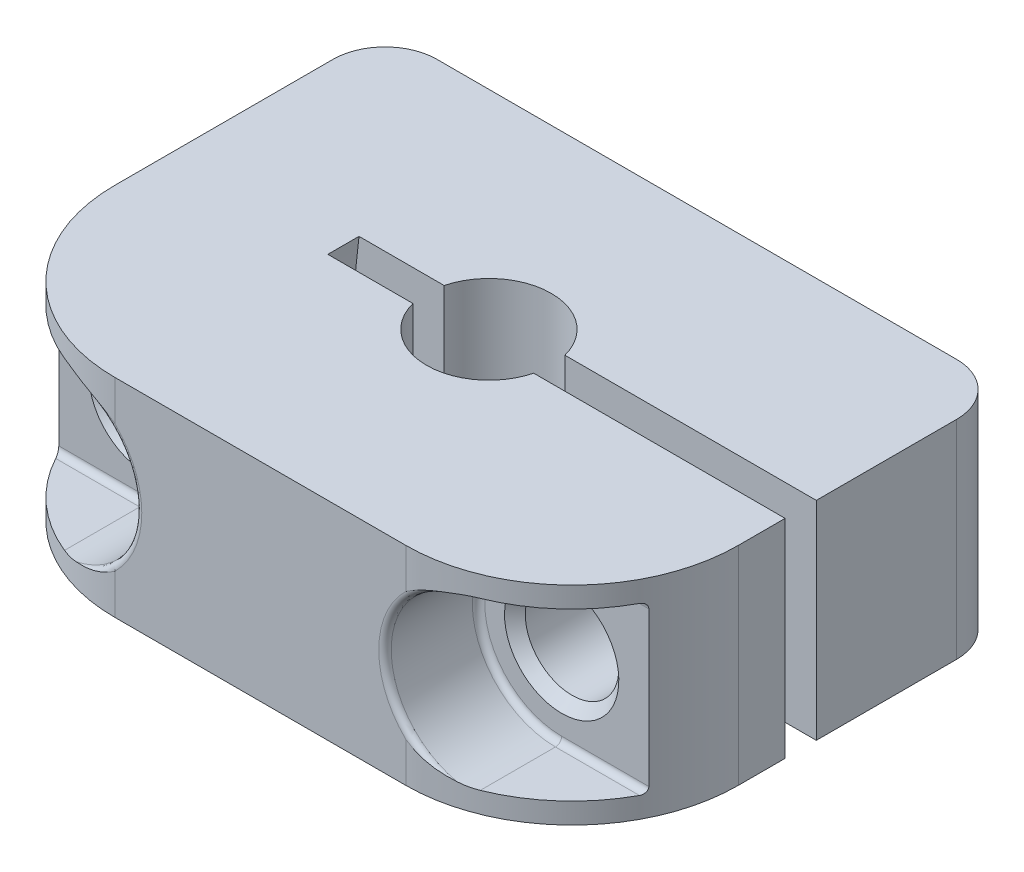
ISO-10303-21;
HEADER;
FILE_DESCRIPTION(('STEP AP214'),'2;1');
FILE_NAME('part.step','',(''),(''),'','','');
FILE_SCHEMA(('AUTOMOTIVE_DESIGN { 1 0 10303 214 1 1 1 1 }'));
ENDSEC;
DATA;
#1=APPLICATION_CONTEXT('core data for automotive mechanical design processes');
#2=APPLICATION_PROTOCOL_DEFINITION('international standard','automotive_design',2000,#1);
#3=PRODUCT_CONTEXT('',#1,'mechanical');
#4=PRODUCT('Part','Part','',(#3));
#5=PRODUCT_RELATED_PRODUCT_CATEGORY('part','',(#4));
#6=PRODUCT_DEFINITION_FORMATION('','',#4);
#7=PRODUCT_DEFINITION_CONTEXT('part definition',#1,'design');
#8=PRODUCT_DEFINITION('design','',#6,#7);
#9=PRODUCT_DEFINITION_SHAPE('','',#8);
#10=(LENGTH_UNIT() NAMED_UNIT(*) SI_UNIT(.MILLI.,.METRE.));
#11=(NAMED_UNIT(*) PLANE_ANGLE_UNIT() SI_UNIT($,.RADIAN.));
#12=(NAMED_UNIT(*) SI_UNIT($,.STERADIAN.) SOLID_ANGLE_UNIT());
#13=UNCERTAINTY_MEASURE_WITH_UNIT(LENGTH_MEASURE(1.E-05),#10,'distance_accuracy_value','');
#14=(GEOMETRIC_REPRESENTATION_CONTEXT(3) GLOBAL_UNCERTAINTY_ASSIGNED_CONTEXT((#13)) GLOBAL_UNIT_ASSIGNED_CONTEXT((#10,
#11,#12)) REPRESENTATION_CONTEXT('',''));
#15=CARTESIAN_POINT('',(0.,0.,0.));
#16=DIRECTION('',(0.,0.,1.));
#17=DIRECTION('',(1.,0.,0.));
#18=AXIS2_PLACEMENT_3D('',#15,#16,#17);
#19=CARTESIAN_POINT('',(20.,0.,16.8));
#20=DIRECTION('',(0.,0.,-1.));
#21=DIRECTION('',(0.,1.,0.));
#22=AXIS2_PLACEMENT_3D('',#19,#20,#21);
#23=TOROIDAL_SURFACE('',#22,3.7,0.299999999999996);
#24=CARTESIAN_POINT('',(20.,0.,16.5));
#25=DIRECTION('',(0.,0.,-1.));
#26=DIRECTION('',(0.,-1.,0.));
#27=AXIS2_PLACEMENT_3D('',#24,#25,#26);
#28=CIRCLE('',#27,3.7);
#29=CARTESIAN_POINT('',(20.,3.7,16.5));
#30=VERTEX_POINT('',#29);
#31=CARTESIAN_POINT('',(20.,-3.7,16.5));
#32=VERTEX_POINT('',#31);
#33=EDGE_CURVE('E231',#30,#32,#28,.F.);
#34=ORIENTED_EDGE('',*,*,#33,.F.);
#35=CARTESIAN_POINT('',(20.,3.7,16.8));
#36=DIRECTION('',(1.,0.,0.));
#37=DIRECTION('',(0.,1.,0.));
#38=AXIS2_PLACEMENT_3D('',#35,#36,#37);
#39=CIRCLE('',#38,0.299999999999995);
#40=CARTESIAN_POINT('',(20.,4.,16.8));
#41=VERTEX_POINT('',#40);
#42=EDGE_CURVE('E222',#30,#41,#39,.T.);
#43=ORIENTED_EDGE('',*,*,#42,.T.);
#44=CARTESIAN_POINT('',(20.,0.,16.8));
#45=DIRECTION('',(0.,0.,1.));
#46=DIRECTION('',(0.,-1.,0.));
#47=AXIS2_PLACEMENT_3D('',#44,#45,#46);
#48=CIRCLE('',#47,4.);
#49=CARTESIAN_POINT('',(20.,-4.,16.8));
#50=VERTEX_POINT('',#49);
#51=EDGE_CURVE('E505',#41,#50,#48,.T.);
#52=ORIENTED_EDGE('',*,*,#51,.T.);
#53=CARTESIAN_POINT('',(20.,-3.7,16.8));
#54=DIRECTION('',(1.,0.,0.));
#55=DIRECTION('',(0.,1.,0.));
#56=AXIS2_PLACEMENT_3D('',#53,#54,#55);
#57=CIRCLE('',#56,0.299999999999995);
#58=EDGE_CURVE('E223',#50,#32,#57,.T.);
#59=ORIENTED_EDGE('',*,*,#58,.T.);
#60=EDGE_LOOP('',(#34,#43,#52,#59));
#61=FACE_BOUND('',#60,.T.);
#62=ADVANCED_FACE('F14',(#61),#23,.F.);
#63=CARTESIAN_POINT('',(30.,-3.7,16.8));
#64=DIRECTION('',(1.,0.,0.));
#65=DIRECTION('',(0.,1.,0.));
#66=AXIS2_PLACEMENT_3D('',#63,#64,#65);
#67=CYLINDRICAL_SURFACE('',#66,0.299999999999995);
#68=DIRECTION('',(1.,0.,0.));
#69=VECTOR('',#68,1.);
#70=CARTESIAN_POINT('',(23.7,-3.7,16.5));
#71=LINE('',#70,#69);
#72=CARTESIAN_POINT('',(24.1937472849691,-3.7,16.5));
#73=VERTEX_POINT('',#72);
#74=EDGE_CURVE('E215',#32,#73,#71,.T.);
#75=ORIENTED_EDGE('',*,*,#74,.F.);
#76=ORIENTED_EDGE('',*,*,#58,.F.);
#77=DIRECTION('',(-1.,0.,0.));
#78=VECTOR('',#77,1.);
#79=CARTESIAN_POINT('',(30.,-4.,16.8));
#80=LINE('',#79,#78);
#81=CARTESIAN_POINT('',(24.0398863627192,-4.,16.8));
#82=VERTEX_POINT('',#81);
#83=EDGE_CURVE('E217',#82,#50,#80,.T.);
#84=ORIENTED_EDGE('',*,*,#83,.F.);
#85=CARTESIAN_POINT('',(24.1937472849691,-3.7,16.5));
#86=CARTESIAN_POINT('',(24.1937550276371,-3.71562766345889,16.4999810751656));
#87=CARTESIAN_POINT('',(24.1931538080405,-3.73124207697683,16.5012197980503));
#88=CARTESIAN_POINT('',(24.1907951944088,-3.76195797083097,16.5060629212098));
#89=CARTESIAN_POINT('',(24.1890416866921,-3.77706099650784,16.5096593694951));
#90=CARTESIAN_POINT('',(24.1844405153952,-3.80637198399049,16.5190680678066));
#91=CARTESIAN_POINT('',(24.1815933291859,-3.82058033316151,16.5248793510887));
#92=CARTESIAN_POINT('',(24.1749044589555,-3.84776867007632,16.5384747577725));
#93=CARTESIAN_POINT('',(24.1710622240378,-3.86074797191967,16.5462599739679));
#94=CARTESIAN_POINT('',(24.1623398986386,-3.88566589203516,16.5638443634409));
#95=CARTESIAN_POINT('',(24.1574260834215,-3.89754667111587,16.5737085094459));
#96=CARTESIAN_POINT('',(24.146798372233,-3.91948367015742,16.594914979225));
#97=CARTESIAN_POINT('',(24.1410843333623,-3.92953956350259,16.6062575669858));
#98=CARTESIAN_POINT('',(24.1284220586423,-3.94856595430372,16.6312274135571));
#99=CARTESIAN_POINT('',(24.1214081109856,-3.9573419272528,16.6449693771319));
#100=CARTESIAN_POINT('',(24.106766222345,-3.97247350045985,16.6734358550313));
#101=CARTESIAN_POINT('',(24.0991376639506,-3.97882662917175,16.6881613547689));
#102=CARTESIAN_POINT('',(24.0830701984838,-3.98931617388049,16.7189285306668));
#103=CARTESIAN_POINT('',(24.0746100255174,-3.99333340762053,16.7349995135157));
#104=CARTESIAN_POINT('',(24.0574130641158,-3.99867433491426,16.7673949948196));
#105=CARTESIAN_POINT('',(24.0486769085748,-4.00000379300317,16.7837188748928));
#106=CARTESIAN_POINT('',(24.0398863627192,-4.,16.8));
#107=B_SPLINE_CURVE_WITH_KNOTS('',3,(#85,#86,#87,#88,#89,#90,#91,#92,#93,#94,#95,#96,#97,#98,
#99,#100,#101,#102,#103,#104,#105,#106),.UNSPECIFIED.,.F.,.F.,(4,2,2,2,2,2,2,2,2,2,4),(0.,
0.0468017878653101,0.0934465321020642,0.140070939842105,0.186721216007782,0.23513385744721,
0.283555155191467,0.336587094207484,0.389672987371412,0.445272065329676,0.500751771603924),.UNSPECIFIED.);
#108=EDGE_CURVE('E19',#73,#82,#107,.T.);
#109=ORIENTED_EDGE('',*,*,#108,.F.);
#110=EDGE_LOOP('',(#75,#76,#84,#109));
#111=FACE_BOUND('',#110,.T.);
#112=ADVANCED_FACE('F214',(#111),#67,.F.);
#113=CARTESIAN_POINT('',(30.,3.7,16.8));
#114=DIRECTION('',(1.,0.,0.));
#115=DIRECTION('',(0.,1.,0.));
#116=AXIS2_PLACEMENT_3D('',#113,#114,#115);
#117=CYLINDRICAL_SURFACE('',#116,0.299999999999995);
#118=DIRECTION('',(1.,0.,0.));
#119=VECTOR('',#118,1.);
#120=CARTESIAN_POINT('',(30.,4.,16.8));
#121=LINE('',#120,#119);
#122=CARTESIAN_POINT('',(24.0398863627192,4.,16.8));
#123=VERTEX_POINT('',#122);
#124=EDGE_CURVE('E436',#41,#123,#121,.T.);
#125=ORIENTED_EDGE('',*,*,#124,.F.);
#126=ORIENTED_EDGE('',*,*,#42,.F.);
#127=DIRECTION('',(1.,0.,0.));
#128=VECTOR('',#127,1.);
#129=CARTESIAN_POINT('',(23.7,3.7,16.5));
#130=LINE('',#129,#128);
#131=CARTESIAN_POINT('',(24.1937472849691,3.7,16.5));
#132=VERTEX_POINT('',#131);
#133=EDGE_CURVE('E234',#132,#30,#130,.F.);
#134=ORIENTED_EDGE('',*,*,#133,.F.);
#135=CARTESIAN_POINT('',(24.0398863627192,4.,16.8));
#136=CARTESIAN_POINT('',(24.0498290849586,4.00000624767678,16.7815870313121));
#137=CARTESIAN_POINT('',(24.059702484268,3.99830412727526,16.7631159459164));
#138=CARTESIAN_POINT('',(24.0790833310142,3.9914594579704,16.7265259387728));
#139=CARTESIAN_POINT('',(24.0885890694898,3.986302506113,16.7084088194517));
#140=CARTESIAN_POINT('',(24.1069411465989,3.97250782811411,16.6731168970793));
#141=CARTESIAN_POINT('',(24.1157858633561,3.96386185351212,16.6559444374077));
#142=CARTESIAN_POINT('',(24.1324822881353,3.94318041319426,16.6232625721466));
#143=CARTESIAN_POINT('',(24.1403357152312,3.93115093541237,16.6077502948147));
#144=CARTESIAN_POINT('',(24.1541588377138,3.90504095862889,16.5802554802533));
#145=CARTESIAN_POINT('',(24.1602302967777,3.89121023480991,16.5680876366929));
#146=CARTESIAN_POINT('',(24.171042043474,3.8611942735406,16.5463085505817));
#147=CARTESIAN_POINT('',(24.1757826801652,3.84500965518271,16.5366966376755));
#148=CARTESIAN_POINT('',(24.1832466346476,3.81279714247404,16.5215097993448));
#149=CARTESIAN_POINT('',(24.1861397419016,3.79696717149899,16.515596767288));
#150=CARTESIAN_POINT('',(24.190581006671,3.76437901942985,16.5065040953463));
#151=CARTESIAN_POINT('',(24.1921323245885,3.74762311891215,16.5033180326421));
#152=CARTESIAN_POINT('',(24.1932360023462,3.72561005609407,16.5010506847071));
#153=CARTESIAN_POINT('',(24.1934277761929,3.72049390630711,16.5006566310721));
#154=CARTESIAN_POINT('',(24.1936832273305,3.7102526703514,16.5001316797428));
#155=CARTESIAN_POINT('',(24.1937470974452,3.70512760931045,16.5000003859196));
#156=CARTESIAN_POINT('',(24.1937472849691,3.7,16.5));
#157=B_SPLINE_CURVE_WITH_KNOTS('',3,(#135,#136,#137,#138,#139,#140,#141,#142,#143,#144,#145,
#146,#147,#148,#149,#150,#151,#152,#153,#154,#155,#156),.UNSPECIFIED.,.F.,.F.,(4,2,2,2,2,2,2,2,
2,2,4),(0.,0.0627380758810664,0.125739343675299,0.188890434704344,0.251930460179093,
0.309790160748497,0.367634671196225,0.418796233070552,0.46983696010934,0.485235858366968,
0.500611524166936),.UNSPECIFIED.);
#158=EDGE_CURVE('E238',#123,#132,#157,.T.);
#159=ORIENTED_EDGE('',*,*,#158,.F.);
#160=EDGE_LOOP('',(#125,#126,#134,#159));
#161=FACE_BOUND('',#160,.T.);
#162=ADVANCED_FACE('F837',(#161),#117,.F.);
#163=CARTESIAN_POINT('',(20.,0.,0.));
#164=DIRECTION('',(0.,0.,1.));
#165=DIRECTION('',(0.,-1.,0.));
#166=AXIS2_PLACEMENT_3D('',#163,#164,#165);
#167=CYLINDRICAL_SURFACE('',#166,4.);
#168=DIRECTION('',(0.,0.,1.));
#169=VECTOR('',#168,1.);
#170=CARTESIAN_POINT('',(20.,-4.,21.));
#171=LINE('',#170,#169);
#172=CARTESIAN_POINT('',(20.,-4.,20.4161984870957));
#173=VERTEX_POINT('',#172);
#174=EDGE_CURVE('E443',#50,#173,#171,.T.);
#175=ORIENTED_EDGE('',*,*,#174,.F.);
#176=ORIENTED_EDGE('',*,*,#51,.F.);
#177=DIRECTION('',(0.,0.,1.));
#178=VECTOR('',#177,1.);
#179=CARTESIAN_POINT('',(20.,4.,16.8));
#180=LINE('',#179,#178);
#181=CARTESIAN_POINT('',(20.,4.,20.4161984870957));
#182=VERTEX_POINT('',#181);
#183=EDGE_CURVE('E440',#182,#41,#180,.F.);
#184=ORIENTED_EDGE('',*,*,#183,.F.);
#185=CARTESIAN_POINT('',(19.1702534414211,3.91299382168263,20.7));
#186=CARTESIAN_POINT('',(19.2397785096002,3.92774012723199,20.6804084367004));
#187=CARTESIAN_POINT('',(19.3094091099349,3.94056545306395,20.6597624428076));
#188=CARTESIAN_POINT('',(19.4483919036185,3.96240498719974,20.6164717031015));
#189=CARTESIAN_POINT('',(19.5177442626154,3.97143152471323,20.5938337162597));
#190=CARTESIAN_POINT('',(19.656137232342,3.9857996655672,20.5465411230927));
#191=CARTESIAN_POINT('',(19.7251778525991,3.99114138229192,20.5218865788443));
#192=CARTESIAN_POINT('',(19.8629433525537,3.99824882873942,20.4705415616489));
#193=CARTESIAN_POINT('',(19.9316664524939,4.00000276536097,20.4438446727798));
#194=CARTESIAN_POINT('',(20.,4.,20.4161984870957));
#195=B_SPLINE_CURVE_WITH_KNOTS('',3,(#185,#186,#187,#188,#189,#190,#191,#192,#193,#194),
.UNSPECIFIED.,.F.,.F.,(4,2,2,2,4),(0.,0.221128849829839,0.44153437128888,0.661933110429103,
0.883055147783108),.UNSPECIFIED.);
#196=CARTESIAN_POINT('',(19.1702534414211,3.91299382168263,20.7));
#197=VERTEX_POINT('',#196);
#198=EDGE_CURVE('E514',#197,#182,#195,.T.);
#199=ORIENTED_EDGE('',*,*,#198,.F.);
#200=CARTESIAN_POINT('',(20.,0.,20.7));
#201=DIRECTION('',(0.,0.,-1.));
#202=DIRECTION('',(0.,1.,0.));
#203=AXIS2_PLACEMENT_3D('',#200,#201,#202);
#204=CIRCLE('',#203,4.);
#205=CARTESIAN_POINT('',(19.1702534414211,-3.91299382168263,20.7));
#206=VERTEX_POINT('',#205);
#207=EDGE_CURVE('E393',#206,#197,#204,.T.);
#208=ORIENTED_EDGE('',*,*,#207,.F.);
#209=CARTESIAN_POINT('',(20.,-4.,20.4161984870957));
#210=CARTESIAN_POINT('',(19.9316664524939,-4.00000276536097,20.4438446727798));
#211=CARTESIAN_POINT('',(19.8629433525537,-3.99824882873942,20.4705415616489));
#212=CARTESIAN_POINT('',(19.7251778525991,-3.99114138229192,20.5218865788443));
#213=CARTESIAN_POINT('',(19.656137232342,-3.9857996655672,20.5465411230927));
#214=CARTESIAN_POINT('',(19.5177442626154,-3.97143152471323,20.5938337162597));
#215=CARTESIAN_POINT('',(19.4483919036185,-3.96240498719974,20.6164717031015));
#216=CARTESIAN_POINT('',(19.3094091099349,-3.94056545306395,20.6597624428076));
#217=CARTESIAN_POINT('',(19.2397785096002,-3.92774012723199,20.6804084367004));
#218=CARTESIAN_POINT('',(19.1702534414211,-3.91299382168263,20.7));
#219=B_SPLINE_CURVE_WITH_KNOTS('',3,(#209,#210,#211,#212,#213,#214,#215,#216,#217,#218),
.UNSPECIFIED.,.F.,.F.,(4,2,2,2,4),(0.,0.221122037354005,0.441520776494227,0.661926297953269,
0.883055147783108),.UNSPECIFIED.);
#220=EDGE_CURVE('E513',#173,#206,#219,.T.);
#221=ORIENTED_EDGE('',*,*,#220,.F.);
#222=EDGE_LOOP('',(#175,#176,#184,#199,#208,#221));
#223=FACE_BOUND('',#222,.T.);
#224=ADVANCED_FACE('F834',(#223),#167,.F.);
#225=CARTESIAN_POINT('',(0.,0.,16.4999999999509));
#226=DIRECTION('',(0.,0.,1.));
#227=DIRECTION('',(0.,-1.,0.));
#228=AXIS2_PLACEMENT_3D('',#225,#226,#227);
#229=CONICAL_SURFACE('',#228,2.74999999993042,0.785398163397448);
#230=CARTESIAN_POINT('',(0.,0.,16.5000000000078));
#231=DIRECTION('',(0.,0.,1.));
#232=DIRECTION('',(0.,-1.,0.));
#233=AXIS2_PLACEMENT_3D('',#230,#231,#232);
#234=CIRCLE('',#233,2.74999999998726);
#235=CARTESIAN_POINT('',(0.,-2.74999999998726,16.5000000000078));
#236=VERTEX_POINT('',#235);
#237=EDGE_CURVE('E619',#236,#236,#234,.F.);
#238=ORIENTED_EDGE('',*,*,#237,.F.);
#239=EDGE_LOOP('',(#238));
#240=FACE_BOUND('',#239,.T.);
#241=CARTESIAN_POINT('',(0.,0.,16.));
#242=DIRECTION('',(0.,0.,1.));
#243=DIRECTION('',(0.,-1.,0.));
#244=AXIS2_PLACEMENT_3D('',#241,#242,#243);
#245=CIRCLE('',#244,2.25);
#246=CARTESIAN_POINT('',(0.,-2.25,16.));
#247=VERTEX_POINT('',#246);
#248=EDGE_CURVE('E447',#247,#247,#245,.F.);
#249=ORIENTED_EDGE('',*,*,#248,.T.);
#250=EDGE_LOOP('',(#249));
#251=FACE_BOUND('',#250,.T.);
#252=ADVANCED_FACE('F478',(#240,#251),#229,.F.);
#253=CARTESIAN_POINT('',(0.,0.,16.8));
#254=DIRECTION('',(0.,0.,-1.));
#255=DIRECTION('',(0.,1.,0.));
#256=AXIS2_PLACEMENT_3D('',#253,#254,#255);
#257=TOROIDAL_SURFACE('',#256,3.7,0.299999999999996);
#258=CARTESIAN_POINT('',(0.,3.7,16.8));
#259=DIRECTION('',(-1.,0.,0.));
#260=DIRECTION('',(0.,-1.,0.));
#261=AXIS2_PLACEMENT_3D('',#258,#259,#260);
#262=CIRCLE('',#261,0.299999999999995);
#263=CARTESIAN_POINT('',(0.,4.,16.8));
#264=VERTEX_POINT('',#263);
#265=CARTESIAN_POINT('',(0.,3.7,16.5));
#266=VERTEX_POINT('',#265);
#267=EDGE_CURVE('E453',#264,#266,#262,.T.);
#268=ORIENTED_EDGE('',*,*,#267,.T.);
#269=CARTESIAN_POINT('',(0.,0.,16.5));
#270=DIRECTION('',(0.,0.,-1.));
#271=DIRECTION('',(0.,1.,0.));
#272=AXIS2_PLACEMENT_3D('',#269,#270,#271);
#273=CIRCLE('',#272,3.70000000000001);
#274=CARTESIAN_POINT('',(0.,-3.7,16.5));
#275=VERTEX_POINT('',#274);
#276=EDGE_CURVE('E350',#275,#266,#273,.F.);
#277=ORIENTED_EDGE('',*,*,#276,.F.);
#278=CARTESIAN_POINT('',(0.,-3.7,16.8));
#279=DIRECTION('',(-1.,0.,0.));
#280=DIRECTION('',(0.,-1.,0.));
#281=AXIS2_PLACEMENT_3D('',#278,#279,#280);
#282=CIRCLE('',#281,0.299999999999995);
#283=CARTESIAN_POINT('',(0.,-4.,16.8));
#284=VERTEX_POINT('',#283);
#285=EDGE_CURVE('E462',#275,#284,#282,.T.);
#286=ORIENTED_EDGE('',*,*,#285,.T.);
#287=CARTESIAN_POINT('',(0.,0.,16.8));
#288=DIRECTION('',(0.,0.,1.));
#289=DIRECTION('',(0.,-1.,0.));
#290=AXIS2_PLACEMENT_3D('',#287,#288,#289);
#291=CIRCLE('',#290,4.);
#292=EDGE_CURVE('E450',#284,#264,#291,.T.);
#293=ORIENTED_EDGE('',*,*,#292,.T.);
#294=EDGE_LOOP('',(#268,#277,#286,#293));
#295=FACE_BOUND('',#294,.T.);
#296=ADVANCED_FACE('F472',(#295),#257,.F.);
#297=CARTESIAN_POINT('',(-10.,-3.7,16.8));
#298=DIRECTION('',(-1.,0.,0.));
#299=DIRECTION('',(0.,-1.,0.));
#300=AXIS2_PLACEMENT_3D('',#297,#298,#299);
#301=CYLINDRICAL_SURFACE('',#300,0.299999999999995);
#302=ORIENTED_EDGE('',*,*,#285,.F.);
#303=DIRECTION('',(1.,0.,0.));
#304=VECTOR('',#303,1.);
#305=CARTESIAN_POINT('',(3.7,-3.7,16.5));
#306=LINE('',#305,#304);
#307=CARTESIAN_POINT('',(-4.19374728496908,-3.7,16.5));
#308=VERTEX_POINT('',#307);
#309=EDGE_CURVE('E344',#308,#275,#306,.T.);
#310=ORIENTED_EDGE('',*,*,#309,.F.);
#311=CARTESIAN_POINT('',(-4.03988636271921,-4.,16.8));
#312=CARTESIAN_POINT('',(-4.04982908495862,-4.00000624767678,16.7815870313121));
#313=CARTESIAN_POINT('',(-4.05970248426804,-3.99830412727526,16.7631159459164));
#314=CARTESIAN_POINT('',(-4.0790833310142,-3.9914594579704,16.7265259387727));
#315=CARTESIAN_POINT('',(-4.08858906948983,-3.986302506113,16.7084088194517));
#316=CARTESIAN_POINT('',(-4.10694114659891,-3.97250782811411,16.6731168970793));
#317=CARTESIAN_POINT('',(-4.11578586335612,-3.96386185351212,16.6559444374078));
#318=CARTESIAN_POINT('',(-4.13248228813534,-3.94318041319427,16.6232625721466));
#319=CARTESIAN_POINT('',(-4.14033571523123,-3.93115093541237,16.6077502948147));
#320=CARTESIAN_POINT('',(-4.15415883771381,-3.90504095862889,16.5802554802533));
#321=CARTESIAN_POINT('',(-4.16023029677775,-3.89121023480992,16.5680876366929));
#322=CARTESIAN_POINT('',(-4.171042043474,-3.8611942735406,16.5463085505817));
#323=CARTESIAN_POINT('',(-4.17578268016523,-3.84500965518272,16.5366966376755));
#324=CARTESIAN_POINT('',(-4.1832466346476,-3.81279714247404,16.5215097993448));
#325=CARTESIAN_POINT('',(-4.18613974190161,-3.796967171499,16.515596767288));
#326=CARTESIAN_POINT('',(-4.19058100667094,-3.76437901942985,16.5065040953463));
#327=CARTESIAN_POINT('',(-4.19213232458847,-3.74762311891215,16.5033180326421));
#328=CARTESIAN_POINT('',(-4.19323600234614,-3.72561005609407,16.5010506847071));
#329=CARTESIAN_POINT('',(-4.19342777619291,-3.72049390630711,16.5006566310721));
#330=CARTESIAN_POINT('',(-4.19368322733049,-3.7102526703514,16.5001316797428));
#331=CARTESIAN_POINT('',(-4.19374709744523,-3.70512760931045,16.5000003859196));
#332=CARTESIAN_POINT('',(-4.19374728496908,-3.7,16.5));
#333=B_SPLINE_CURVE_WITH_KNOTS('',3,(#311,#312,#313,#314,#315,#316,#317,#318,#319,#320,#321,
#322,#323,#324,#325,#326,#327,#328,#329,#330,#331,#332),.UNSPECIFIED.,.F.,.F.,(4,2,2,2,2,2,2,2,
2,2,4),(0.,0.0627380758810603,0.125739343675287,0.188890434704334,0.251930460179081,
0.309790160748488,0.367634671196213,0.418796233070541,0.469836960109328,0.485235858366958,
0.500611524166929),.UNSPECIFIED.);
#334=CARTESIAN_POINT('',(-4.03988636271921,-4.,16.8));
#335=VERTEX_POINT('',#334);
#336=EDGE_CURVE('E465',#335,#308,#333,.T.);
#337=ORIENTED_EDGE('',*,*,#336,.F.);
#338=DIRECTION('',(1.,0.,0.));
#339=VECTOR('',#338,1.);
#340=CARTESIAN_POINT('',(-10.,-4.,16.8));
#341=LINE('',#340,#339);
#342=EDGE_CURVE('E400',#335,#284,#341,.T.);
#343=ORIENTED_EDGE('',*,*,#342,.T.);
#344=EDGE_LOOP('',(#302,#310,#337,#343));
#345=FACE_BOUND('',#344,.T.);
#346=ADVANCED_FACE('F477',(#345),#301,.F.);
#347=CARTESIAN_POINT('',(-10.,3.7,16.8));
#348=DIRECTION('',(-1.,0.,0.));
#349=DIRECTION('',(0.,-1.,0.));
#350=AXIS2_PLACEMENT_3D('',#347,#348,#349);
#351=CYLINDRICAL_SURFACE('',#350,0.299999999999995);
#352=ORIENTED_EDGE('',*,*,#267,.F.);
#353=DIRECTION('',(-1.,0.,0.));
#354=VECTOR('',#353,1.);
#355=CARTESIAN_POINT('',(-10.,4.,16.8));
#356=LINE('',#355,#354);
#357=CARTESIAN_POINT('',(-4.03988636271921,4.,16.8));
#358=VERTEX_POINT('',#357);
#359=EDGE_CURVE('E336',#264,#358,#356,.T.);
#360=ORIENTED_EDGE('',*,*,#359,.T.);
#361=CARTESIAN_POINT('',(-4.19374728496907,3.7,16.5));
#362=CARTESIAN_POINT('',(-4.19375502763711,3.71562766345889,16.4999810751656));
#363=CARTESIAN_POINT('',(-4.19315380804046,3.73124207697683,16.5012197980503));
#364=CARTESIAN_POINT('',(-4.19079519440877,3.76195797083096,16.5060629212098));
#365=CARTESIAN_POINT('',(-4.18904168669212,3.77706099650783,16.5096593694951));
#366=CARTESIAN_POINT('',(-4.18444051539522,3.80637198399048,16.5190680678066));
#367=CARTESIAN_POINT('',(-4.1815933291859,3.82058033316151,16.5248793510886));
#368=CARTESIAN_POINT('',(-4.1749044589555,3.84776867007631,16.5384747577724));
#369=CARTESIAN_POINT('',(-4.17106222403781,3.86074797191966,16.5462599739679));
#370=CARTESIAN_POINT('',(-4.1623398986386,3.88566589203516,16.5638443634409));
#371=CARTESIAN_POINT('',(-4.15742608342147,3.89754667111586,16.5737085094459));
#372=CARTESIAN_POINT('',(-4.146798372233,3.91948367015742,16.594914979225));
#373=CARTESIAN_POINT('',(-4.14108433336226,3.92953956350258,16.6062575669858));
#374=CARTESIAN_POINT('',(-4.12842205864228,3.94856595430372,16.6312274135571));
#375=CARTESIAN_POINT('',(-4.12140811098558,3.9573419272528,16.6449693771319));
#376=CARTESIAN_POINT('',(-4.10676622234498,3.97247350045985,16.6734358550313));
#377=CARTESIAN_POINT('',(-4.09913766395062,3.97882662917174,16.6881613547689));
#378=CARTESIAN_POINT('',(-4.08307019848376,3.98931617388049,16.7189285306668));
#379=CARTESIAN_POINT('',(-4.07461002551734,3.99333340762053,16.7349995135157));
#380=CARTESIAN_POINT('',(-4.0574130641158,3.99867433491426,16.7673949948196));
#381=CARTESIAN_POINT('',(-4.04867690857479,4.00000379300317,16.7837188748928));
#382=CARTESIAN_POINT('',(-4.03988636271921,4.,16.8));
#383=B_SPLINE_CURVE_WITH_KNOTS('',3,(#361,#362,#363,#364,#365,#366,#367,#368,#369,#370,#371,
#372,#373,#374,#375,#376,#377,#378,#379,#380,#381,#382),.UNSPECIFIED.,.F.,.F.,(4,2,2,2,2,2,2,2,
2,2,4),(0.,0.0468017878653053,0.0934465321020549,0.140070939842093,0.186721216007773,
0.235133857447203,0.283555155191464,0.336587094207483,0.389672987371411,0.44527206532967,
0.500751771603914),.UNSPECIFIED.);
#384=CARTESIAN_POINT('',(-4.19374728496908,3.7,16.5));
#385=VERTEX_POINT('',#384);
#386=EDGE_CURVE('E456',#385,#358,#383,.T.);
#387=ORIENTED_EDGE('',*,*,#386,.F.);
#388=DIRECTION('',(1.,0.,0.));
#389=VECTOR('',#388,1.);
#390=CARTESIAN_POINT('',(3.7,3.7,16.5));
#391=LINE('',#390,#389);
#392=EDGE_CURVE('E1221',#266,#385,#391,.F.);
#393=ORIENTED_EDGE('',*,*,#392,.F.);
#394=EDGE_LOOP('',(#352,#360,#387,#393));
#395=FACE_BOUND('',#394,.T.);
#396=ADVANCED_FACE('F674',(#395),#351,.F.);
#397=CARTESIAN_POINT('',(0.,0.,0.));
#398=DIRECTION('',(0.,0.,1.));
#399=DIRECTION('',(0.,-1.,0.));
#400=AXIS2_PLACEMENT_3D('',#397,#398,#399);
#401=CYLINDRICAL_SURFACE('',#400,4.);
#402=ORIENTED_EDGE('',*,*,#292,.F.);
#403=DIRECTION('',(0.,0.,1.));
#404=VECTOR('',#403,1.);
#405=CARTESIAN_POINT('',(0.,-4.,21.));
#406=LINE('',#405,#404);
#407=CARTESIAN_POINT('',(0.,-4.,20.4161984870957));
#408=VERTEX_POINT('',#407);
#409=EDGE_CURVE('E622',#284,#408,#406,.T.);
#410=ORIENTED_EDGE('',*,*,#409,.T.);
#411=CARTESIAN_POINT('',(0.829746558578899,-3.91299382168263,20.7));
#412=CARTESIAN_POINT('',(0.760221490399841,-3.92774012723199,20.6804084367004));
#413=CARTESIAN_POINT('',(0.69059089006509,-3.94056545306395,20.6597624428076));
#414=CARTESIAN_POINT('',(0.551608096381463,-3.96240498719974,20.6164717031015));
#415=CARTESIAN_POINT('',(0.482255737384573,-3.97143152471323,20.5938337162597));
#416=CARTESIAN_POINT('',(0.343862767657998,-3.9857996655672,20.5465411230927));
#417=CARTESIAN_POINT('',(0.274822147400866,-3.99114138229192,20.5218865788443));
#418=CARTESIAN_POINT('',(0.137056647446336,-3.99824882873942,20.4705415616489));
#419=CARTESIAN_POINT('',(0.0683335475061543,-4.00000276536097,20.4438446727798));
#420=CARTESIAN_POINT('',(0.,-4.,20.4161984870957));
#421=B_SPLINE_CURVE_WITH_KNOTS('',3,(#411,#412,#413,#414,#415,#416,#417,#418,#419,#420),
.UNSPECIFIED.,.F.,.F.,(4,2,2,2,4),(0.,0.22112884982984,0.441534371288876,0.661933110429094,
0.883055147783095),.UNSPECIFIED.);
#422=CARTESIAN_POINT('',(0.829746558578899,-3.91299382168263,20.7));
#423=VERTEX_POINT('',#422);
#424=EDGE_CURVE('E461',#423,#408,#421,.T.);
#425=ORIENTED_EDGE('',*,*,#424,.F.);
#426=CARTESIAN_POINT('',(0.,0.,20.7));
#427=DIRECTION('',(0.,0.,-1.));
#428=DIRECTION('',(0.,1.,0.));
#429=AXIS2_PLACEMENT_3D('',#426,#427,#428);
#430=CIRCLE('',#429,4.);
#431=CARTESIAN_POINT('',(0.829746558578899,3.91299382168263,20.7));
#432=VERTEX_POINT('',#431);
#433=EDGE_CURVE('E286',#432,#423,#430,.T.);
#434=ORIENTED_EDGE('',*,*,#433,.F.);
#435=CARTESIAN_POINT('',(0.,4.,20.4161984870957));
#436=CARTESIAN_POINT('',(0.0683335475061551,4.00000276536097,20.4438446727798));
#437=CARTESIAN_POINT('',(0.137056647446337,3.99824882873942,20.4705415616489));
#438=CARTESIAN_POINT('',(0.274822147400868,3.99114138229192,20.5218865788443));
#439=CARTESIAN_POINT('',(0.343862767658,3.9857996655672,20.5465411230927));
#440=CARTESIAN_POINT('',(0.482255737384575,3.97143152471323,20.5938337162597));
#441=CARTESIAN_POINT('',(0.551608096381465,3.96240498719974,20.6164717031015));
#442=CARTESIAN_POINT('',(0.690590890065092,3.94056545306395,20.6597624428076));
#443=CARTESIAN_POINT('',(0.760221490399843,3.92774012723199,20.6804084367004));
#444=CARTESIAN_POINT('',(0.829746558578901,3.91299382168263,20.7));
#445=B_SPLINE_CURVE_WITH_KNOTS('',3,(#435,#436,#437,#438,#439,#440,#441,#442,#443,#444),
.UNSPECIFIED.,.F.,.F.,(4,2,2,2,4),(0.,0.221122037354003,0.44152077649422,0.661926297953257,
0.883055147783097),.UNSPECIFIED.);
#446=CARTESIAN_POINT('',(0.,4.,20.4161984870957));
#447=VERTEX_POINT('',#446);
#448=EDGE_CURVE('E455',#447,#432,#445,.T.);
#449=ORIENTED_EDGE('',*,*,#448,.F.);
#450=DIRECTION('',(0.,0.,1.));
#451=VECTOR('',#450,1.);
#452=CARTESIAN_POINT('',(0.,4.,16.8));
#453=LINE('',#452,#451);
#454=EDGE_CURVE('E341',#447,#264,#453,.F.);
#455=ORIENTED_EDGE('',*,*,#454,.T.);
#456=EDGE_LOOP('',(#402,#410,#425,#434,#449,#455));
#457=FACE_BOUND('',#456,.T.);
#458=ADVANCED_FACE('F634',(#457),#401,.F.);
#459=CARTESIAN_POINT('',(0.,0.,0.));
#460=DIRECTION('',(0.,0.,1.));
#461=DIRECTION('',(0.,-1.,0.));
#462=AXIS2_PLACEMENT_3D('',#459,#460,#461);
#463=CYLINDRICAL_SURFACE('',#462,2.25);
#464=ORIENTED_EDGE('',*,*,#248,.F.);
#465=EDGE_LOOP('',(#464));
#466=FACE_BOUND('',#465,.T.);
#467=CARTESIAN_POINT('',(0.,0.,0.499999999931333));
#468=DIRECTION('',(0.,0.,-1.));
#469=DIRECTION('',(0.,1.,0.));
#470=AXIS2_PLACEMENT_3D('',#467,#468,#469);
#471=CIRCLE('',#470,2.25000000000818);
#472=CARTESIAN_POINT('',(0.,2.25000000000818,0.499999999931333));
#473=VERTEX_POINT('',#472);
#474=EDGE_CURVE('E276',#473,#473,#471,.T.);
#475=ORIENTED_EDGE('',*,*,#474,.T.);
#476=EDGE_LOOP('',(#475));
#477=FACE_BOUND('',#476,.T.);
#478=ADVANCED_FACE('F683',(#466,#477),#463,.F.);
#479=CARTESIAN_POINT('',(20.,0.,16.4999999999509));
#480=DIRECTION('',(0.,0.,1.));
#481=DIRECTION('',(0.,-1.,0.));
#482=AXIS2_PLACEMENT_3D('',#479,#480,#481);
#483=CONICAL_SURFACE('',#482,2.74999999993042,0.785398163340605);
#484=CARTESIAN_POINT('',(20.,0.,16.5000000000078));
#485=DIRECTION('',(0.,0.,1.));
#486=DIRECTION('',(0.,-1.,0.));
#487=AXIS2_PLACEMENT_3D('',#484,#485,#486);
#488=CIRCLE('',#487,2.74999999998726);
#489=CARTESIAN_POINT('',(20.,-2.74999999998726,16.5000000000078));
#490=VERTEX_POINT('',#489);
#491=EDGE_CURVE('E439',#490,#490,#488,.F.);
#492=ORIENTED_EDGE('',*,*,#491,.F.);
#493=EDGE_LOOP('',(#492));
#494=FACE_BOUND('',#493,.T.);
#495=CARTESIAN_POINT('',(20.,0.,16.));
#496=DIRECTION('',(0.,0.,1.));
#497=DIRECTION('',(0.,-1.,0.));
#498=AXIS2_PLACEMENT_3D('',#495,#496,#497);
#499=CIRCLE('',#498,2.25);
#500=CARTESIAN_POINT('',(20.,-2.25,16.));
#501=VERTEX_POINT('',#500);
#502=EDGE_CURVE('E257',#501,#501,#499,.F.);
#503=ORIENTED_EDGE('',*,*,#502,.T.);
#504=EDGE_LOOP('',(#503));
#505=FACE_BOUND('',#504,.T.);
#506=ADVANCED_FACE('F910',(#494,#505),#483,.F.);
#507=CARTESIAN_POINT('',(30.,-4.,21.));
#508=DIRECTION('',(0.,1.,0.));
#509=DIRECTION('',(-1.,0.,0.));
#510=AXIS2_PLACEMENT_3D('',#507,#508,#509);
#511=PLANE('',#510);
#512=ORIENTED_EDGE('',*,*,#83,.T.);
#513=ORIENTED_EDGE('',*,*,#174,.T.);
#514=CARTESIAN_POINT('',(17.,-4.,13.));
#515=DIRECTION('',(0.,-1.,0.));
#516=DIRECTION('',(1.,0.,0.));
#517=AXIS2_PLACEMENT_3D('',#514,#515,#516);
#518=CIRCLE('',#517,8.);
#519=EDGE_CURVE('E613',#82,#173,#518,.T.);
#520=ORIENTED_EDGE('',*,*,#519,.F.);
#521=EDGE_LOOP('',(#512,#513,#520));
#522=FACE_BOUND('',#521,.T.);
#523=ADVANCED_FACE('F919',(#522),#511,.T.);
#524=CARTESIAN_POINT('',(30.,4.,16.8));
#525=DIRECTION('',(0.,-1.,0.));
#526=DIRECTION('',(1.,0.,0.));
#527=AXIS2_PLACEMENT_3D('',#524,#525,#526);
#528=PLANE('',#527);
#529=ORIENTED_EDGE('',*,*,#183,.T.);
#530=ORIENTED_EDGE('',*,*,#124,.T.);
#531=CARTESIAN_POINT('',(17.,4.,13.));
#532=DIRECTION('',(0.,-1.,0.));
#533=DIRECTION('',(1.,0.,0.));
#534=AXIS2_PLACEMENT_3D('',#531,#532,#533);
#535=CIRCLE('',#534,8.);
#536=EDGE_CURVE('E241',#182,#123,#535,.F.);
#537=ORIENTED_EDGE('',*,*,#536,.F.);
#538=EDGE_LOOP('',(#529,#530,#537));
#539=FACE_BOUND('',#538,.T.);
#540=ADVANCED_FACE('F929',(#539),#528,.T.);
#541=CARTESIAN_POINT('',(23.7,0.,16.5));
#542=DIRECTION('',(0.,0.,1.));
#543=DIRECTION('',(0.,-1.,0.));
#544=AXIS2_PLACEMENT_3D('',#541,#542,#543);
#545=PLANE('',#544);
#546=DIRECTION('',(0.,-1.,0.));
#547=VECTOR('',#546,1.);
#548=CARTESIAN_POINT('',(24.1937472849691,-5.,16.5));
#549=LINE('',#548,#547);
#550=EDGE_CURVE('E229',#132,#73,#549,.T.);
#551=ORIENTED_EDGE('',*,*,#550,.F.);
#552=ORIENTED_EDGE('',*,*,#133,.T.);
#553=ORIENTED_EDGE('',*,*,#33,.T.);
#554=ORIENTED_EDGE('',*,*,#74,.T.);
#555=EDGE_LOOP('',(#551,#552,#553,#554));
#556=FACE_BOUND('',#555,.T.);
#557=ORIENTED_EDGE('',*,*,#491,.T.);
#558=EDGE_LOOP('',(#557));
#559=FACE_BOUND('',#558,.T.);
#560=ADVANCED_FACE('F226',(#556,#559),#545,.T.);
#561=CARTESIAN_POINT('',(20.,0.,20.7));
#562=DIRECTION('',(0.,0.,-1.));
#563=DIRECTION('',(0.,1.,0.));
#564=AXIS2_PLACEMENT_3D('',#561,#562,#563);
#565=TOROIDAL_SURFACE('',#564,4.3,0.300000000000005);
#566=CARTESIAN_POINT('',(19.1702534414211,3.91299382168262,20.7));
#567=CARTESIAN_POINT('',(19.1054286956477,3.89928997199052,20.7182720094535));
#568=CARTESIAN_POINT('',(19.0403889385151,3.88547715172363,20.7357253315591));
#569=CARTESIAN_POINT('',(18.9025524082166,3.85540745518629,20.7708665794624));
#570=CARTESIAN_POINT('',(18.8297250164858,3.83905231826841,20.7883499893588));
#571=CARTESIAN_POINT('',(18.6762364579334,3.80268144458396,20.8229210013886));
#572=CARTESIAN_POINT('',(18.5955680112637,3.78246133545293,20.8397676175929));
#573=CARTESIAN_POINT('',(18.4717810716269,3.74910297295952,20.8636269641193));
#574=CARTESIAN_POINT('',(18.4285581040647,3.73701673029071,20.8715832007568));
#575=CARTESIAN_POINT('',(18.3402008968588,3.71129986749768,20.8870941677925));
#576=CARTESIAN_POINT('',(18.2950734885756,3.69762314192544,20.89461182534));
#577=CARTESIAN_POINT('',(18.2029571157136,3.66847844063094,20.909148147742));
#578=CARTESIAN_POINT('',(18.1559788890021,3.65295680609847,20.9161274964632));
#579=CARTESIAN_POINT('',(18.0602329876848,3.6198551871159,20.9294895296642));
#580=CARTESIAN_POINT('',(18.0114807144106,3.60221379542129,20.9358308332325));
#581=CARTESIAN_POINT('',(17.9122875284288,3.56458679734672,20.9478196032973));
#582=CARTESIAN_POINT('',(17.8618676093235,3.54453192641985,20.9534238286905));
#583=CARTESIAN_POINT('',(17.7594730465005,3.50177591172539,20.9638435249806));
#584=CARTESIAN_POINT('',(17.7075259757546,3.4789976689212,20.9686141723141));
#585=CARTESIAN_POINT('',(17.6022492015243,3.43047994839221,20.9772756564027));
#586=CARTESIAN_POINT('',(17.5489547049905,3.40465571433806,20.9811204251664));
#587=CARTESIAN_POINT('',(17.4411979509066,3.34972317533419,20.9878448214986));
#588=CARTESIAN_POINT('',(17.3867796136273,3.32052284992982,20.9906775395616));
#589=CARTESIAN_POINT('',(17.2770378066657,3.25851081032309,20.9952998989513));
#590=CARTESIAN_POINT('',(17.2217680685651,3.2256003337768,20.9970422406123));
#591=CARTESIAN_POINT('',(17.1106356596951,3.15585152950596,20.9994161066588));
#592=CARTESIAN_POINT('',(17.0548374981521,3.11890881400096,21.0000004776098));
#593=CARTESIAN_POINT('',(17.,3.08058436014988,21.));
#594=B_SPLINE_CURVE_WITH_KNOTS('',3,(#566,#567,#568,#569,#570,#571,#572,#573,#574,#575,#576,
#577,#578,#579,#580,#581,#582,#583,#584,#585,#586,#587,#588,#589,#590,#591,#592,#593),
.UNSPECIFIED.,.F.,.F.,(4,2,2,2,2,2,2,2,2,2,2,2,2,4),(0.,0.206198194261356,0.43614598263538,
0.690612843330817,0.827341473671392,0.970570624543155,1.12044293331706,1.27710808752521,
1.44072091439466,1.61143912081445,1.78942069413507,1.97482098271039,2.16778948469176,
2.36846638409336),.UNSPECIFIED.);
#595=CARTESIAN_POINT('',(17.,3.08058436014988,21.));
#596=VERTEX_POINT('',#595);
#597=EDGE_CURVE('E246',#596,#197,#594,.F.);
#598=ORIENTED_EDGE('',*,*,#597,.F.);
#599=CARTESIAN_POINT('',(20.,0.,21.));
#600=DIRECTION('',(0.,0.,1.));
#601=DIRECTION('',(-0.697674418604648,0.716414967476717,0.));
#602=AXIS2_PLACEMENT_3D('',#599,#600,#601);
#603=CIRCLE('',#602,4.3);
#604=CARTESIAN_POINT('',(17.,-3.08058436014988,21.));
#605=VERTEX_POINT('',#604);
#606=EDGE_CURVE('E405',#596,#605,#603,.T.);
#607=ORIENTED_EDGE('',*,*,#606,.T.);
#608=CARTESIAN_POINT('',(17.,-3.08058436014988,21.));
#609=CARTESIAN_POINT('',(17.0548375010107,-3.11890881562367,21.0000004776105));
#610=CARTESIAN_POINT('',(17.1106356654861,-3.1558515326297,20.9994161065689));
#611=CARTESIAN_POINT('',(17.2217680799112,-3.22560033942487,20.997042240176));
#612=CARTESIAN_POINT('',(17.2770378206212,-3.25851081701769,20.9952998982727));
#613=CARTESIAN_POINT('',(17.3867796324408,-3.32052285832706,20.9906775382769));
#614=CARTESIAN_POINT('',(17.4411979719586,-3.34972318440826,20.9878448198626));
#615=CARTESIAN_POINT('',(17.5489547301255,-3.40465572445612,20.9811204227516));
#616=CARTESIAN_POINT('',(17.6022492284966,-3.4304799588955,20.9772756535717));
#617=CARTESIAN_POINT('',(17.7075260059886,-3.47899767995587,20.9686141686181));
#618=CARTESIAN_POINT('',(17.7594730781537,-3.50177592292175,20.9638435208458));
#619=CARTESIAN_POINT('',(17.8618676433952,-3.54453193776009,20.9534238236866));
#620=CARTESIAN_POINT('',(17.912287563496,-3.56458680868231,20.9478195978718));
#621=CARTESIAN_POINT('',(18.0114807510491,-3.60221380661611,20.9358308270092));
#622=CARTESIAN_POINT('',(18.0602330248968,-3.61985519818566,20.9294895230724));
#623=CARTESIAN_POINT('',(18.1559789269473,-3.65295681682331,20.9161274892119));
#624=CARTESIAN_POINT('',(18.2029571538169,-3.66847845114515,20.9091481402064));
#625=CARTESIAN_POINT('',(18.2950735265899,-3.69762315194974,20.8946118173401));
#626=CARTESIAN_POINT('',(18.340200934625,-3.71129987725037,20.8870941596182));
#627=CARTESIAN_POINT('',(18.428558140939,-3.73701673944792,20.871583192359));
#628=CARTESIAN_POINT('',(18.4717811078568,-3.74910298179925,20.8636269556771));
#629=CARTESIAN_POINT('',(18.5955680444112,-3.78246134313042,20.8397676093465));
#630=CARTESIAN_POINT('',(18.6762364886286,-3.80268145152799,20.8229209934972));
#631=CARTESIAN_POINT('',(18.8297250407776,-3.83905232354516,20.7883499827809));
#632=CARTESIAN_POINT('',(18.9025524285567,-3.8554074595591,20.7708665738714));
#633=CARTESIAN_POINT('',(19.0403889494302,-3.88547715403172,20.7357253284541));
#634=CARTESIAN_POINT('',(19.1054287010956,-3.89928997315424,20.7182720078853));
#635=CARTESIAN_POINT('',(19.1702534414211,-3.91299382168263,20.7));
#636=B_SPLINE_CURVE_WITH_KNOTS('',3,(#608,#609,#610,#611,#612,#613,#614,#615,#616,#617,#618,
#619,#620,#621,#622,#623,#624,#625,#626,#627,#628,#629,#630,#631,#632,#633,#634,#635),
.UNSPECIFIED.,.F.,.F.,(4,2,2,2,2,2,2,2,2,2,2,2,2,4),(0.,0.200676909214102,0.393645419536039,
0.579045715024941,0.757027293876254,0.927745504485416,1.09135833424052,1.24802349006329,
1.39789579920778,1.54112494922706,1.6778535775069,1.93232043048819,2.1622682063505,
2.36846638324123),.UNSPECIFIED.);
#637=EDGE_CURVE('E612',#206,#605,#636,.F.);
#638=ORIENTED_EDGE('',*,*,#637,.F.);
#639=ORIENTED_EDGE('',*,*,#207,.T.);
#640=EDGE_LOOP('',(#598,#607,#638,#639));
#641=FACE_BOUND('',#640,.T.);
#642=ADVANCED_FACE('F368',(#641),#565,.T.);
#643=CARTESIAN_POINT('',(-10.,-4.,21.));
#644=DIRECTION('',(0.,-1.,0.));
#645=DIRECTION('',(1.,0.,0.));
#646=AXIS2_PLACEMENT_3D('',#643,#644,#645);
#647=PLANE('',#646);
#648=ORIENTED_EDGE('',*,*,#342,.F.);
#649=CARTESIAN_POINT('',(3.,-4.,13.));
#650=DIRECTION('',(0.,-1.,0.));
#651=DIRECTION('',(1.,0.,0.));
#652=AXIS2_PLACEMENT_3D('',#649,#650,#651);
#653=CIRCLE('',#652,8.);
#654=EDGE_CURVE('E606',#408,#335,#653,.T.);
#655=ORIENTED_EDGE('',*,*,#654,.F.);
#656=ORIENTED_EDGE('',*,*,#409,.F.);
#657=EDGE_LOOP('',(#648,#655,#656));
#658=FACE_BOUND('',#657,.T.);
#659=ADVANCED_FACE('F365',(#658),#647,.F.);
#660=CARTESIAN_POINT('',(3.7,0.,16.5));
#661=DIRECTION('',(0.,0.,1.));
#662=DIRECTION('',(0.,-1.,0.));
#663=AXIS2_PLACEMENT_3D('',#660,#661,#662);
#664=PLANE('',#663);
#665=DIRECTION('',(0.,-1.,0.));
#666=VECTOR('',#665,1.);
#667=CARTESIAN_POINT('',(-4.19374728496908,-5.,16.5));
#668=LINE('',#667,#666);
#669=EDGE_CURVE('E605',#308,#385,#668,.F.);
#670=ORIENTED_EDGE('',*,*,#669,.F.);
#671=ORIENTED_EDGE('',*,*,#309,.T.);
#672=ORIENTED_EDGE('',*,*,#276,.T.);
#673=ORIENTED_EDGE('',*,*,#392,.T.);
#674=EDGE_LOOP('',(#670,#671,#672,#673));
#675=FACE_BOUND('',#674,.T.);
#676=ORIENTED_EDGE('',*,*,#237,.T.);
#677=EDGE_LOOP('',(#676));
#678=FACE_BOUND('',#677,.T.);
#679=ADVANCED_FACE('F356',(#675,#678),#664,.T.);
#680=CARTESIAN_POINT('',(-10.,4.,16.8));
#681=DIRECTION('',(0.,1.,0.));
#682=DIRECTION('',(-1.,0.,0.));
#683=AXIS2_PLACEMENT_3D('',#680,#681,#682);
#684=PLANE('',#683);
#685=ORIENTED_EDGE('',*,*,#454,.F.);
#686=CARTESIAN_POINT('',(3.,4.,13.));
#687=DIRECTION('',(0.,-1.,0.));
#688=DIRECTION('',(1.,0.,0.));
#689=AXIS2_PLACEMENT_3D('',#686,#687,#688);
#690=CIRCLE('',#689,8.);
#691=EDGE_CURVE('E601',#358,#447,#690,.F.);
#692=ORIENTED_EDGE('',*,*,#691,.F.);
#693=ORIENTED_EDGE('',*,*,#359,.F.);
#694=EDGE_LOOP('',(#685,#692,#693));
#695=FACE_BOUND('',#694,.T.);
#696=ADVANCED_FACE('F318',(#695),#684,.F.);
#697=CARTESIAN_POINT('',(0.,0.,20.7));
#698=DIRECTION('',(0.,0.,-1.));
#699=DIRECTION('',(0.,1.,0.));
#700=AXIS2_PLACEMENT_3D('',#697,#698,#699);
#701=TOROIDAL_SURFACE('',#700,4.3,0.300000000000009);
#702=CARTESIAN_POINT('',(2.99999999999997,3.08058436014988,21.));
#703=CARTESIAN_POINT('',(2.94516249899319,3.11890881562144,21.0000004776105));
#704=CARTESIAN_POINT('',(2.88936433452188,3.15585153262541,20.999416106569));
#705=CARTESIAN_POINT('',(2.77823192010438,3.22560033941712,20.9970422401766));
#706=CARTESIAN_POINT('',(2.72296217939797,3.2585108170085,20.9952998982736));
#707=CARTESIAN_POINT('',(2.61322036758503,3.32052285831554,20.9906775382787));
#708=CARTESIAN_POINT('',(2.55880202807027,3.34972318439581,20.9878448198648));
#709=CARTESIAN_POINT('',(2.45104526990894,3.40465572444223,20.9811204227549));
#710=CARTESIAN_POINT('',(2.39775077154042,3.43047995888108,20.9772756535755));
#711=CARTESIAN_POINT('',(2.29247399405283,3.47899767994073,20.9686141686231));
#712=CARTESIAN_POINT('',(2.24052692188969,3.50177592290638,20.9638435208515));
#713=CARTESIAN_POINT('',(2.13813235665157,3.54453193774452,20.9534238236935));
#714=CARTESIAN_POINT('',(2.08771243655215,3.56458680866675,20.9478195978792));
#715=CARTESIAN_POINT('',(1.98851924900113,3.60221380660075,20.9358308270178));
#716=CARTESIAN_POINT('',(1.93976697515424,3.61985519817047,20.9294895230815));
#717=CARTESIAN_POINT('',(1.84402107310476,3.65295681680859,20.9161274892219));
#718=CARTESIAN_POINT('',(1.79704284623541,3.66847845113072,20.9091481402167));
#719=CARTESIAN_POINT('',(1.7049264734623,3.69762315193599,20.8946118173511));
#720=CARTESIAN_POINT('',(1.65979906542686,3.71129987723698,20.8870941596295));
#721=CARTESIAN_POINT('',(1.57144185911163,3.73701673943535,20.8715831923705));
#722=CARTESIAN_POINT('',(1.52821889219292,3.74910298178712,20.8636269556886));
#723=CARTESIAN_POINT('',(1.40443195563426,3.78246134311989,20.8397676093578));
#724=CARTESIAN_POINT('',(1.32376351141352,3.80268145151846,20.822920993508));
#725=CARTESIAN_POINT('',(1.17027495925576,3.83905232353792,20.7883499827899));
#726=CARTESIAN_POINT('',(1.09744757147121,3.8554074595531,20.7708665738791));
#727=CARTESIAN_POINT('',(0.959611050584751,3.88547715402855,20.7357253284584));
#728=CARTESIAN_POINT('',(0.894571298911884,3.89928997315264,20.7182720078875));
#729=CARTESIAN_POINT('',(0.829746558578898,3.91299382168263,20.7));
#730=B_SPLINE_CURVE_WITH_KNOTS('',3,(#702,#703,#704,#705,#706,#707,#708,#709,#710,#711,#712,
#713,#714,#715,#716,#717,#718,#719,#720,#721,#722,#723,#724,#725,#726,#727,#728,#729),
.UNSPECIFIED.,.F.,.F.,(4,2,2,2,2,2,2,2,2,2,2,2,2,4),(0.,0.200676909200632,0.393645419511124,
0.57904571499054,0.757027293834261,0.927745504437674,1.09135833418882,1.24802349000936,
1.39789579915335,1.5411249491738,1.67785357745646,1.93232043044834,2.16226820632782,
2.3684663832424),.UNSPECIFIED.);
#731=CARTESIAN_POINT('',(3.,3.08058436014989,21.));
#732=VERTEX_POINT('',#731);
#733=EDGE_CURVE('E604',#432,#732,#730,.F.);
#734=ORIENTED_EDGE('',*,*,#733,.F.);
#735=ORIENTED_EDGE('',*,*,#433,.T.);
#736=CARTESIAN_POINT('',(0.82974655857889,-3.91299382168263,20.7));
#737=CARTESIAN_POINT('',(0.894571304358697,-3.89928997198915,20.7182720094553));
#738=CARTESIAN_POINT('',(0.959611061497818,-3.88547715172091,20.7357253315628));
#739=CARTESIAN_POINT('',(1.09744759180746,-3.85540745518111,20.770866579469));
#740=CARTESIAN_POINT('',(1.17027498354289,-3.83905231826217,20.7883499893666));
#741=CARTESIAN_POINT('',(1.32376354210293,-3.80268144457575,20.822921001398));
#742=CARTESIAN_POINT('',(1.40443198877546,-3.78246133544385,20.8397676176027));
#743=CARTESIAN_POINT('',(1.52821892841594,-3.74910297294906,20.8636269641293));
#744=CARTESIAN_POINT('',(1.57144189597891,-3.73701673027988,20.8715832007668));
#745=CARTESIAN_POINT('',(1.65979910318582,-3.71129986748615,20.8870941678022));
#746=CARTESIAN_POINT('',(1.70492651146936,-3.69762314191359,20.8946118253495));
#747=CARTESIAN_POINT('',(1.79704288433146,-3.6684784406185,20.9091481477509));
#748=CARTESIAN_POINT('',(1.84402111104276,-3.65295680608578,20.9161274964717));
#749=CARTESIAN_POINT('',(1.93976701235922,-3.6198551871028,20.929489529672));
#750=CARTESIAN_POINT('',(1.98851928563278,-3.60221379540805,20.9358308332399));
#751=CARTESIAN_POINT('',(2.08771247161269,-3.56458679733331,20.9478196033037));
#752=CARTESIAN_POINT('',(2.13813239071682,-3.54453192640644,20.9534238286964));
#753=CARTESIAN_POINT('',(2.24052695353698,-3.50177591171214,20.9638435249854));
#754=CARTESIAN_POINT('',(2.29247402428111,-3.47899766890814,20.9686141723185));
#755=CARTESIAN_POINT('',(2.39775079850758,-3.43047994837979,20.977275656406));
#756=CARTESIAN_POINT('',(2.45104529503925,-3.40465571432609,20.9811204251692));
#757=CARTESIAN_POINT('',(2.55880204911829,-3.34972317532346,20.9878448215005));
#758=CARTESIAN_POINT('',(2.61322038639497,-3.32052284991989,20.9906775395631));
#759=CARTESIAN_POINT('',(2.72296219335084,-3.25851081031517,20.9952998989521));
#760=CARTESIAN_POINT('',(2.77823193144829,-3.22560033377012,20.9970422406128));
#761=CARTESIAN_POINT('',(2.88936434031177,-3.15585152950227,20.9994161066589));
#762=CARTESIAN_POINT('',(2.9451625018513,-3.11890881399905,21.0000004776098));
#763=CARTESIAN_POINT('',(2.99999999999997,-3.08058436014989,21.));
#764=B_SPLINE_CURVE_WITH_KNOTS('',3,(#736,#737,#738,#739,#740,#741,#742,#743,#744,#745,#746,
#747,#748,#749,#750,#751,#752,#753,#754,#755,#756,#757,#758,#759,#760,#761,#762,#763),
.UNSPECIFIED.,.F.,.F.,(4,2,2,2,2,2,2,2,2,2,2,2,2,4),(0.,0.206198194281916,0.436145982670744,
0.690612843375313,0.827341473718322,0.970570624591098,1.12044293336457,1.27710808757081,
1.44072091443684,1.61143912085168,1.78942069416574,1.97482098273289,2.16778948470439,
2.36846638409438),.UNSPECIFIED.);
#765=CARTESIAN_POINT('',(3.,-3.08058436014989,21.));
#766=VERTEX_POINT('',#765);
#767=EDGE_CURVE('E300',#766,#423,#764,.F.);
#768=ORIENTED_EDGE('',*,*,#767,.F.);
#769=CARTESIAN_POINT('',(0.,0.,21.));
#770=DIRECTION('',(0.,0.,1.));
#771=DIRECTION('',(0.697674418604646,-0.71641496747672,0.));
#772=AXIS2_PLACEMENT_3D('',#769,#770,#771);
#773=CIRCLE('',#772,4.29999999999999);
#774=EDGE_CURVE('E244',#766,#732,#773,.T.);
#775=ORIENTED_EDGE('',*,*,#774,.T.);
#776=EDGE_LOOP('',(#734,#735,#768,#775));
#777=FACE_BOUND('',#776,.T.);
#778=ADVANCED_FACE('F307',(#777),#701,.T.);
#779=CARTESIAN_POINT('',(0.,0.,0.));
#780=DIRECTION('',(0.,0.,-1.));
#781=DIRECTION('',(0.,1.,0.));
#782=AXIS2_PLACEMENT_3D('',#779,#780,#781);
#783=CONICAL_SURFACE('',#782,2.74999999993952,0.785398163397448);
#784=ORIENTED_EDGE('',*,*,#474,.F.);
#785=EDGE_LOOP('',(#784));
#786=FACE_BOUND('',#785,.T.);
#787=CARTESIAN_POINT('',(-2.49999999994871,1.14564392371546,9.80581189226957E-12));
#788=CARTESIAN_POINT('',(-2.52844361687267,1.0835314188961,2.21365273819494E-05));
#789=CARTESIAN_POINT('',(-2.55414728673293,1.02021089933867,0.000485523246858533));
#790=CARTESIAN_POINT('',(-2.60028683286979,0.89174448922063,0.0019000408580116));
#791=CARTESIAN_POINT('',(-2.62072758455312,0.826600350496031,0.00285071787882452));
#792=CARTESIAN_POINT('',(-2.65661712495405,0.694916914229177,0.00484721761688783));
#793=CARTESIAN_POINT('',(-2.67206264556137,0.628376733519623,0.00589310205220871));
#794=CARTESIAN_POINT('',(-2.6981086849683,0.494348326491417,0.00782840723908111));
#795=CARTESIAN_POINT('',(-2.70870771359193,0.426859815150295,0.00871777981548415));
#796=CARTESIAN_POINT('',(-2.73482167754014,0.211943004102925,0.0109782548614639));
#797=CARTESIAN_POINT('',(-2.7415825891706,0.0633569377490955,0.0116957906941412));
#798=CARTESIAN_POINT('',(-2.73319567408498,-0.233050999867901,0.010896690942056));
#799=CARTESIAN_POINT('',(-2.71806316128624,-0.380873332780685,0.00938161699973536));
#800=CARTESIAN_POINT('',(-2.6722700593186,-0.633201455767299,0.0058710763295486));
#801=CARTESIAN_POINT('',(-2.6468797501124,-0.738665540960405,0.00411437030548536));
#802=CARTESIAN_POINT('',(-2.59920351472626,-0.893879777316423,0.00191902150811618));
#803=CARTESIAN_POINT('',(-2.58171367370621,-0.945119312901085,0.00126053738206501));
#804=CARTESIAN_POINT('',(-2.54339424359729,-1.04637545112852,0.000304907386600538));
#805=CARTESIAN_POINT('',(-2.52256233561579,-1.09639117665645,8.01364449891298E-06));
#806=CARTESIAN_POINT('',(-2.49999999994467,-1.14564392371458,0.));
#807=B_SPLINE_CURVE_WITH_KNOTS('',3,(#787,#788,#789,#790,#791,#792,#793,#794,#795,#796,#797,
#798,#799,#800,#801,#802,#803,#804,#805,#806),.UNSPECIFIED.,.F.,.F.,(4,2,2,2,2,2,2,2,2,4),(0.,
0.204817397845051,0.409444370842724,0.614204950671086,0.819028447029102,1.26346066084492,
1.70758215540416,2.03226829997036,2.19460118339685,2.35704719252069),.UNSPECIFIED.);
#808=CARTESIAN_POINT('',(-2.49999999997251,1.14564392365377,0.));
#809=VERTEX_POINT('',#808);
#810=CARTESIAN_POINT('',(-2.49999999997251,-1.14564392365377,0.));
#811=VERTEX_POINT('',#810);
#812=EDGE_CURVE('E292',#809,#811,#807,.T.);
#813=ORIENTED_EDGE('',*,*,#812,.F.);
#814=CARTESIAN_POINT('',(0.,0.,0.));
#815=DIRECTION('',(0.,0.,-1.));
#816=DIRECTION('',(0.,1.,0.));
#817=AXIS2_PLACEMENT_3D('',#814,#815,#816);
#818=CIRCLE('',#817,2.74999999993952);
#819=EDGE_CURVE('E750',#809,#811,#818,.T.);
#820=ORIENTED_EDGE('',*,*,#819,.T.);
#821=EDGE_LOOP('',(#813,#820));
#822=FACE_BOUND('',#821,.T.);
#823=ADVANCED_FACE('F317',(#786,#822),#783,.F.);
#824=CARTESIAN_POINT('',(20.,0.,-5.6843418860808E-11));
#825=DIRECTION('',(0.,0.,-1.));
#826=DIRECTION('',(0.,1.,0.));
#827=AXIS2_PLACEMENT_3D('',#824,#825,#826);
#828=CONICAL_SURFACE('',#827,2.7500000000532,0.785398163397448);
#829=CARTESIAN_POINT('',(20.,0.,0.5));
#830=DIRECTION('',(0.,0.,1.));
#831=DIRECTION('',(0.,-1.,0.));
#832=AXIS2_PLACEMENT_3D('',#829,#830,#831);
#833=CIRCLE('',#832,2.25);
#834=CARTESIAN_POINT('',(20.,-2.25,0.5));
#835=VERTEX_POINT('',#834);
#836=EDGE_CURVE('E268',#835,#835,#833,.T.);
#837=ORIENTED_EDGE('',*,*,#836,.T.);
#838=EDGE_LOOP('',(#837));
#839=FACE_BOUND('',#838,.T.);
#840=CARTESIAN_POINT('',(22.4999999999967,-1.14564392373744,0.));
#841=CARTESIAN_POINT('',(22.5284436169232,-1.08353141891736,2.21365244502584E-05));
#842=CARTESIAN_POINT('',(22.5541472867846,-1.0202108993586,0.000485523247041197));
#843=CARTESIAN_POINT('',(22.6002868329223,-0.891744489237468,0.0019000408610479));
#844=CARTESIAN_POINT('',(22.6207275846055,-0.82660035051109,0.00285071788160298));
#845=CARTESIAN_POINT('',(22.6566171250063,-0.694916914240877,0.00484721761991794));
#846=CARTESIAN_POINT('',(22.6720626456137,-0.628376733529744,0.00589310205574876));
#847=CARTESIAN_POINT('',(22.6981086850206,-0.494348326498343,0.00782840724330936));
#848=CARTESIAN_POINT('',(22.7087077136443,-0.426859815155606,0.00871777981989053));
#849=CARTESIAN_POINT('',(22.7348216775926,-0.211943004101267,0.0109782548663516));
#850=CARTESIAN_POINT('',(22.7415825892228,-0.063356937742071,0.0116957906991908));
#851=CARTESIAN_POINT('',(22.7331956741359,0.233050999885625,0.0108966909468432));
#852=CARTESIAN_POINT('',(22.7180631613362,0.380873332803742,0.0093816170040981));
#853=CARTESIAN_POINT('',(22.6722700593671,0.633201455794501,0.00587107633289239));
#854=CARTESIAN_POINT('',(22.646879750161,0.738665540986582,0.0041143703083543));
#855=CARTESIAN_POINT('',(22.5992035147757,0.893879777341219,0.00191902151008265));
#856=CARTESIAN_POINT('',(22.5817136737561,0.945119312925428,0.00126053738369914));
#857=CARTESIAN_POINT('',(22.5433942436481,1.04637545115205,0.000304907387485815));
#858=CARTESIAN_POINT('',(22.5225623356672,1.09639117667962,8.0136449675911E-06));
#859=CARTESIAN_POINT('',(22.4999999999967,1.14564392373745,0.));
#860=B_SPLINE_CURVE_WITH_KNOTS('',3,(#840,#841,#842,#843,#844,#845,#846,#847,#848,#849,#850,
#851,#852,#853,#854,#855,#856,#857,#858,#859),.UNSPECIFIED.,.F.,.F.,(4,2,2,2,2,2,2,2,2,4),(0.,
0.204817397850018,0.409444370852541,0.614204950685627,0.819028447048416,1.26346066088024,
1.70758215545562,2.03226830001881,2.19460118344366,2.35704719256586),.UNSPECIFIED.);
#861=CARTESIAN_POINT('',(22.5,-1.14564392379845,-2.8421709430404E-11));
#862=VERTEX_POINT('',#861);
#863=CARTESIAN_POINT('',(22.4999999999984,1.14564392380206,-2.84218084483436E-11));
#864=VERTEX_POINT('',#863);
#865=EDGE_CURVE('E559',#862,#864,#860,.T.);
#866=ORIENTED_EDGE('',*,*,#865,.F.);
#867=CARTESIAN_POINT('',(20.,0.,-5.6843418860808E-11));
#868=DIRECTION('',(0.,0.,-1.));
#869=DIRECTION('',(0.,1.,0.));
#870=AXIS2_PLACEMENT_3D('',#867,#868,#869);
#871=CIRCLE('',#870,2.7500000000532);
#872=EDGE_CURVE('E282',#862,#864,#871,.T.);
#873=ORIENTED_EDGE('',*,*,#872,.T.);
#874=EDGE_LOOP('',(#866,#873));
#875=FACE_BOUND('',#874,.T.);
#876=ADVANCED_FACE('F567',(#839,#875),#828,.F.);
#877=CARTESIAN_POINT('',(20.,0.,0.));
#878=DIRECTION('',(0.,0.,1.));
#879=DIRECTION('',(0.,-1.,0.));
#880=AXIS2_PLACEMENT_3D('',#877,#878,#879);
#881=CYLINDRICAL_SURFACE('',#880,2.25);
#882=CARTESIAN_POINT('',(20.,0.,9.25));
#883=DIRECTION('',(0.,0.,1.));
#884=DIRECTION('',(0.,-1.,0.));
#885=AXIS2_PLACEMENT_3D('',#882,#883,#884);
#886=CIRCLE('',#885,2.25);
#887=CARTESIAN_POINT('',(20.,-2.25,9.25));
#888=VERTEX_POINT('',#887);
#889=EDGE_CURVE('E272',#888,#888,#886,.F.);
#890=ORIENTED_EDGE('',*,*,#889,.F.);
#891=EDGE_LOOP('',(#890));
#892=FACE_BOUND('',#891,.T.);
#893=ORIENTED_EDGE('',*,*,#836,.F.);
#894=EDGE_LOOP('',(#893));
#895=FACE_BOUND('',#894,.T.);
#896=ADVANCED_FACE('F727',(#892,#895),#881,.F.);
#897=CARTESIAN_POINT('',(42.6862696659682,0.,10.75));
#898=DIRECTION('',(0.,0.,1.));
#899=DIRECTION('',(0.,-1.,0.));
#900=AXIS2_PLACEMENT_3D('',#897,#898,#899);
#901=CYLINDRICAL_SURFACE('',#900,39.9999999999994);
#902=DIRECTION('',(0.,0.,1.));
#903=VECTOR('',#902,1.);
#904=CARTESIAN_POINT('',(2.99999999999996,5.,10.75));
#905=LINE('',#904,#903);
#906=CARTESIAN_POINT('',(2.99999999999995,5.,10.75));
#907=VERTEX_POINT('',#906);
#908=CARTESIAN_POINT('',(2.99999999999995,5.,9.25));
#909=VERTEX_POINT('',#908);
#910=EDGE_CURVE('E261',#907,#909,#905,.F.);
#911=ORIENTED_EDGE('',*,*,#910,.F.);
#912=CARTESIAN_POINT('',(42.6862696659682,0.,10.75));
#913=DIRECTION('',(0.,0.,1.));
#914=DIRECTION('',(0.,-1.,0.));
#915=AXIS2_PLACEMENT_3D('',#912,#913,#914);
#916=CIRCLE('',#915,39.9999999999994);
#917=CARTESIAN_POINT('',(3.,-5.,10.75));
#918=VERTEX_POINT('',#917);
#919=EDGE_CURVE('E544',#907,#918,#916,.T.);
#920=ORIENTED_EDGE('',*,*,#919,.T.);
#921=DIRECTION('',(0.,0.,1.));
#922=VECTOR('',#921,1.);
#923=CARTESIAN_POINT('',(3.,-5.,2.5));
#924=LINE('',#923,#922);
#925=CARTESIAN_POINT('',(3.,-5.,9.25));
#926=VERTEX_POINT('',#925);
#927=EDGE_CURVE('E264',#926,#918,#924,.T.);
#928=ORIENTED_EDGE('',*,*,#927,.F.);
#929=CARTESIAN_POINT('',(42.6862696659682,0.,9.25));
#930=DIRECTION('',(0.,0.,1.));
#931=DIRECTION('',(0.,-1.,0.));
#932=AXIS2_PLACEMENT_3D('',#929,#930,#931);
#933=CIRCLE('',#932,39.9999999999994);
#934=EDGE_CURVE('E549',#909,#926,#933,.T.);
#935=ORIENTED_EDGE('',*,*,#934,.F.);
#936=EDGE_LOOP('',(#911,#920,#928,#935));
#937=FACE_BOUND('',#936,.T.);
#938=ADVANCED_FACE('F730',(#937),#901,.F.);
#939=CARTESIAN_POINT('',(20.,0.,0.));
#940=DIRECTION('',(0.,0.,1.));
#941=DIRECTION('',(0.,-1.,0.));
#942=AXIS2_PLACEMENT_3D('',#939,#940,#941);
#943=CYLINDRICAL_SURFACE('',#942,2.25);
#944=ORIENTED_EDGE('',*,*,#502,.F.);
#945=EDGE_LOOP('',(#944));
#946=FACE_BOUND('',#945,.T.);
#947=CARTESIAN_POINT('',(20.,0.,10.75));
#948=DIRECTION('',(0.,0.,1.));
#949=DIRECTION('',(0.,-1.,0.));
#950=AXIS2_PLACEMENT_3D('',#947,#948,#949);
#951=CIRCLE('',#950,2.25);
#952=CARTESIAN_POINT('',(20.,-2.25,10.75));
#953=VERTEX_POINT('',#952);
#954=EDGE_CURVE('E539',#953,#953,#951,.F.);
#955=ORIENTED_EDGE('',*,*,#954,.T.);
#956=EDGE_LOOP('',(#955));
#957=FACE_BOUND('',#956,.T.);
#958=ADVANCED_FACE('F1006',(#946,#957),#943,.F.);
#959=CARTESIAN_POINT('',(-2.5,-5.,2.5));
#960=DIRECTION('',(0.,-1.,0.));
#961=DIRECTION('',(1.,0.,0.));
#962=AXIS2_PLACEMENT_3D('',#959,#960,#961);
#963=PLANE('',#962);
#964=DIRECTION('',(1.,0.,0.));
#965=VECTOR('',#964,1.);
#966=CARTESIAN_POINT('',(42.6862696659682,-5.,10.75));
#967=LINE('',#966,#965);
#968=CARTESIAN_POINT('',(7.09526249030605,-5.,10.75));
#969=VERTEX_POINT('',#968);
#970=EDGE_CURVE('E547',#918,#969,#967,.T.);
#971=ORIENTED_EDGE('',*,*,#970,.T.);
#972=CARTESIAN_POINT('',(10.,-4.99999999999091,10.));
#973=DIRECTION('',(0.,-1.,0.));
#974=DIRECTION('',(1.,0.,0.));
#975=AXIS2_PLACEMENT_3D('',#972,#973,#974);
#976=CIRCLE('',#975,3.00000000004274);
#977=CARTESIAN_POINT('',(12.9047375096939,-5.,10.75));
#978=VERTEX_POINT('',#977);
#979=EDGE_CURVE('E266',#969,#978,#976,.F.);
#980=ORIENTED_EDGE('',*,*,#979,.T.);
#981=DIRECTION('',(1.,0.,0.));
#982=VECTOR('',#981,1.);
#983=CARTESIAN_POINT('',(42.6862696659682,-5.,10.75));
#984=LINE('',#983,#982);
#985=CARTESIAN_POINT('',(25.,-5.,10.75));
#986=VERTEX_POINT('',#985);
#987=EDGE_CURVE('E543',#978,#986,#984,.T.);
#988=ORIENTED_EDGE('',*,*,#987,.T.);
#989=DIRECTION('',(0.,0.,1.));
#990=VECTOR('',#989,1.);
#991=CARTESIAN_POINT('',(25.,-5.,2.5));
#992=LINE('',#991,#990);
#993=CARTESIAN_POINT('',(25.,-5.,13.));
#994=VERTEX_POINT('',#993);
#995=EDGE_CURVE('E253',#986,#994,#992,.T.);
#996=ORIENTED_EDGE('',*,*,#995,.T.);
#997=CARTESIAN_POINT('',(17.,-5.,13.));
#998=DIRECTION('',(0.,-1.,0.));
#999=DIRECTION('',(1.,0.,0.));
#1000=AXIS2_PLACEMENT_3D('',#997,#998,#999);
#1001=CIRCLE('',#1000,8.);
#1002=CARTESIAN_POINT('',(17.,-5.,21.));
#1003=VERTEX_POINT('',#1002);
#1004=EDGE_CURVE('E610',#1003,#994,#1001,.F.);
#1005=ORIENTED_EDGE('',*,*,#1004,.F.);
#1006=DIRECTION('',(1.,0.,0.));
#1007=VECTOR('',#1006,1.);
#1008=CARTESIAN_POINT('',(17.,-5.,21.));
#1009=LINE('',#1008,#1007);
#1010=CARTESIAN_POINT('',(3.,-5.,21.));
#1011=VERTEX_POINT('',#1010);
#1012=EDGE_CURVE('E240',#1003,#1011,#1009,.F.);
#1013=ORIENTED_EDGE('',*,*,#1012,.T.);
#1014=CARTESIAN_POINT('',(3.,-5.,13.));
#1015=DIRECTION('',(0.,-1.,0.));
#1016=DIRECTION('',(1.,0.,0.));
#1017=AXIS2_PLACEMENT_3D('',#1014,#1015,#1016);
#1018=CIRCLE('',#1017,8.);
#1019=CARTESIAN_POINT('',(-5.,-5.,13.));
#1020=VERTEX_POINT('',#1019);
#1021=EDGE_CURVE('E597',#1020,#1011,#1018,.F.);
#1022=ORIENTED_EDGE('',*,*,#1021,.F.);
#1023=DIRECTION('',(0.,0.,1.));
#1024=VECTOR('',#1023,1.);
#1025=CARTESIAN_POINT('',(-5.,-5.,13.));
#1026=LINE('',#1025,#1024);
#1027=CARTESIAN_POINT('',(-5.,-5.,2.5));
#1028=VERTEX_POINT('',#1027);
#1029=EDGE_CURVE('E289',#1020,#1028,#1026,.F.);
#1030=ORIENTED_EDGE('',*,*,#1029,.T.);
#1031=CARTESIAN_POINT('',(-2.5,-5.,2.5));
#1032=DIRECTION('',(0.,-1.,0.));
#1033=DIRECTION('',(1.,0.,0.));
#1034=AXIS2_PLACEMENT_3D('',#1031,#1032,#1033);
#1035=CIRCLE('',#1034,2.5);
#1036=CARTESIAN_POINT('',(-2.5,-5.,0.));
#1037=VERTEX_POINT('',#1036);
#1038=EDGE_CURVE('E596',#1037,#1028,#1035,.F.);
#1039=ORIENTED_EDGE('',*,*,#1038,.F.);
#1040=DIRECTION('',(1.,0.,0.));
#1041=VECTOR('',#1040,1.);
#1042=CARTESIAN_POINT('',(-2.5,-5.,0.));
#1043=LINE('',#1042,#1041);
#1044=CARTESIAN_POINT('',(22.5,-5.,0.));
#1045=VERTEX_POINT('',#1044);
#1046=EDGE_CURVE('E279',#1037,#1045,#1043,.T.);
#1047=ORIENTED_EDGE('',*,*,#1046,.T.);
#1048=CARTESIAN_POINT('',(22.5,-5.,2.5));
#1049=DIRECTION('',(0.,-1.,0.));
#1050=DIRECTION('',(1.,0.,0.));
#1051=AXIS2_PLACEMENT_3D('',#1048,#1049,#1050);
#1052=CIRCLE('',#1051,2.5);
#1053=CARTESIAN_POINT('',(25.,-5.,2.5));
#1054=VERTEX_POINT('',#1053);
#1055=EDGE_CURVE('E555',#1054,#1045,#1052,.F.);
#1056=ORIENTED_EDGE('',*,*,#1055,.F.);
#1057=DIRECTION('',(0.,0.,1.));
#1058=VECTOR('',#1057,1.);
#1059=CARTESIAN_POINT('',(25.,-5.,2.5));
#1060=LINE('',#1059,#1058);
#1061=CARTESIAN_POINT('',(25.,-5.,9.25));
#1062=VERTEX_POINT('',#1061);
#1063=EDGE_CURVE('E269',#1054,#1062,#1060,.T.);
#1064=ORIENTED_EDGE('',*,*,#1063,.T.);
#1065=DIRECTION('',(1.,0.,0.));
#1066=VECTOR('',#1065,1.);
#1067=CARTESIAN_POINT('',(42.6862696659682,-5.,9.25));
#1068=LINE('',#1067,#1066);
#1069=CARTESIAN_POINT('',(12.9047375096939,-5.,9.25));
#1070=VERTEX_POINT('',#1069);
#1071=EDGE_CURVE('E554',#1070,#1062,#1068,.T.);
#1072=ORIENTED_EDGE('',*,*,#1071,.F.);
#1073=CARTESIAN_POINT('',(10.,-4.99999999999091,10.));
#1074=DIRECTION('',(0.,-1.,0.));
#1075=DIRECTION('',(1.,0.,0.));
#1076=AXIS2_PLACEMENT_3D('',#1073,#1074,#1075);
#1077=CIRCLE('',#1076,3.00000000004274);
#1078=CARTESIAN_POINT('',(7.09526249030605,-5.,9.25));
#1079=VERTEX_POINT('',#1078);
#1080=EDGE_CURVE('E260',#1070,#1079,#1077,.F.);
#1081=ORIENTED_EDGE('',*,*,#1080,.T.);
#1082=DIRECTION('',(1.,0.,0.));
#1083=VECTOR('',#1082,1.);
#1084=CARTESIAN_POINT('',(42.6862696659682,-5.,9.25));
#1085=LINE('',#1084,#1083);
#1086=EDGE_CURVE('E548',#926,#1079,#1085,.T.);
#1087=ORIENTED_EDGE('',*,*,#1086,.F.);
#1088=ORIENTED_EDGE('',*,*,#927,.T.);
#1089=EDGE_LOOP('',(#971,#980,#988,#996,#1005,#1013,#1022,#1030,#1039,#1047,#1056,#1064,#1072,
#1081,#1087,#1088));
#1090=FACE_BOUND('',#1089,.T.);
#1091=ADVANCED_FACE('F809',(#1090),#963,.T.);
#1092=CARTESIAN_POINT('',(17.,-5.,13.));
#1093=DIRECTION('',(0.,-1.,0.));
#1094=DIRECTION('',(1.,0.,0.));
#1095=AXIS2_PLACEMENT_3D('',#1092,#1093,#1094);
#1096=CYLINDRICAL_SURFACE('',#1095,8.);
#1097=ORIENTED_EDGE('',*,*,#550,.T.);
#1098=ORIENTED_EDGE('',*,*,#108,.T.);
#1099=ORIENTED_EDGE('',*,*,#519,.T.);
#1100=ORIENTED_EDGE('',*,*,#220,.T.);
#1101=ORIENTED_EDGE('',*,*,#637,.T.);
#1102=DIRECTION('',(0.,1.,0.));
#1103=VECTOR('',#1102,1.);
#1104=CARTESIAN_POINT('',(17.,-5.,21.));
#1105=LINE('',#1104,#1103);
#1106=EDGE_CURVE('E608',#605,#1003,#1105,.F.);
#1107=ORIENTED_EDGE('',*,*,#1106,.T.);
#1108=ORIENTED_EDGE('',*,*,#1004,.T.);
#1109=DIRECTION('',(0.,-1.,0.));
#1110=VECTOR('',#1109,1.);
#1111=CARTESIAN_POINT('',(25.,-5.,13.));
#1112=LINE('',#1111,#1110);
#1113=CARTESIAN_POINT('',(25.,5.,13.));
#1114=VERTEX_POINT('',#1113);
#1115=EDGE_CURVE('E542',#994,#1114,#1112,.F.);
#1116=ORIENTED_EDGE('',*,*,#1115,.T.);
#1117=CARTESIAN_POINT('',(17.,5.,13.));
#1118=DIRECTION('',(0.,-1.,0.));
#1119=DIRECTION('',(1.,0.,0.));
#1120=AXIS2_PLACEMENT_3D('',#1117,#1118,#1119);
#1121=CIRCLE('',#1120,8.);
#1122=CARTESIAN_POINT('',(17.,5.,21.));
#1123=VERTEX_POINT('',#1122);
#1124=EDGE_CURVE('E256',#1114,#1123,#1121,.T.);
#1125=ORIENTED_EDGE('',*,*,#1124,.T.);
#1126=DIRECTION('',(0.,1.,0.));
#1127=VECTOR('',#1126,1.);
#1128=CARTESIAN_POINT('',(17.,-5.,21.));
#1129=LINE('',#1128,#1127);
#1130=EDGE_CURVE('E794',#1123,#596,#1129,.F.);
#1131=ORIENTED_EDGE('',*,*,#1130,.T.);
#1132=ORIENTED_EDGE('',*,*,#597,.T.);
#1133=ORIENTED_EDGE('',*,*,#198,.T.);
#1134=ORIENTED_EDGE('',*,*,#536,.T.);
#1135=ORIENTED_EDGE('',*,*,#158,.T.);
#1136=EDGE_LOOP('',(#1097,#1098,#1099,#1100,#1101,#1107,#1108,#1116,#1125,#1131,#1132,#1133,
#1134,#1135));
#1137=FACE_BOUND('',#1136,.T.);
#1138=ADVANCED_FACE('F236',(#1137),#1096,.T.);
#1139=CARTESIAN_POINT('',(17.,-5.,21.));
#1140=DIRECTION('',(0.,0.,-1.));
#1141=DIRECTION('',(0.,1.,0.));
#1142=AXIS2_PLACEMENT_3D('',#1139,#1140,#1141);
#1143=PLANE('',#1142);
#1144=ORIENTED_EDGE('',*,*,#606,.F.);
#1145=ORIENTED_EDGE('',*,*,#1130,.F.);
#1146=DIRECTION('',(1.,0.,0.));
#1147=VECTOR('',#1146,1.);
#1148=CARTESIAN_POINT('',(-2.5,5.,21.));
#1149=LINE('',#1148,#1147);
#1150=CARTESIAN_POINT('',(3.,5.,21.));
#1151=VERTEX_POINT('',#1150);
#1152=EDGE_CURVE('E536',#1123,#1151,#1149,.F.);
#1153=ORIENTED_EDGE('',*,*,#1152,.T.);
#1154=DIRECTION('',(0.,-1.,0.));
#1155=VECTOR('',#1154,1.);
#1156=CARTESIAN_POINT('',(3.,-5.,21.));
#1157=LINE('',#1156,#1155);
#1158=EDGE_CURVE('E600',#732,#1151,#1157,.F.);
#1159=ORIENTED_EDGE('',*,*,#1158,.F.);
#1160=ORIENTED_EDGE('',*,*,#774,.F.);
#1161=DIRECTION('',(0.,-1.,0.));
#1162=VECTOR('',#1161,1.);
#1163=CARTESIAN_POINT('',(3.,-5.,21.));
#1164=LINE('',#1163,#1162);
#1165=EDGE_CURVE('E599',#1011,#766,#1164,.F.);
#1166=ORIENTED_EDGE('',*,*,#1165,.F.);
#1167=ORIENTED_EDGE('',*,*,#1012,.F.);
#1168=ORIENTED_EDGE('',*,*,#1106,.F.);
#1169=EDGE_LOOP('',(#1144,#1145,#1153,#1159,#1160,#1166,#1167,#1168));
#1170=FACE_BOUND('',#1169,.T.);
#1171=ADVANCED_FACE('F641',(#1170),#1143,.F.);
#1172=CARTESIAN_POINT('',(3.,-5.,13.));
#1173=DIRECTION('',(0.,-1.,0.));
#1174=DIRECTION('',(1.,0.,0.));
#1175=AXIS2_PLACEMENT_3D('',#1172,#1173,#1174);
#1176=CYLINDRICAL_SURFACE('',#1175,8.);
#1177=ORIENTED_EDGE('',*,*,#1165,.T.);
#1178=ORIENTED_EDGE('',*,*,#767,.T.);
#1179=ORIENTED_EDGE('',*,*,#424,.T.);
#1180=ORIENTED_EDGE('',*,*,#654,.T.);
#1181=ORIENTED_EDGE('',*,*,#336,.T.);
#1182=ORIENTED_EDGE('',*,*,#669,.T.);
#1183=ORIENTED_EDGE('',*,*,#386,.T.);
#1184=ORIENTED_EDGE('',*,*,#691,.T.);
#1185=ORIENTED_EDGE('',*,*,#448,.T.);
#1186=ORIENTED_EDGE('',*,*,#733,.T.);
#1187=ORIENTED_EDGE('',*,*,#1158,.T.);
#1188=CARTESIAN_POINT('',(3.,5.,13.));
#1189=DIRECTION('',(0.,-1.,0.));
#1190=DIRECTION('',(1.,0.,0.));
#1191=AXIS2_PLACEMENT_3D('',#1188,#1189,#1190);
#1192=CIRCLE('',#1191,8.);
#1193=CARTESIAN_POINT('',(-5.,5.,13.));
#1194=VERTEX_POINT('',#1193);
#1195=EDGE_CURVE('E533',#1151,#1194,#1192,.T.);
#1196=ORIENTED_EDGE('',*,*,#1195,.T.);
#1197=DIRECTION('',(0.,1.,0.));
#1198=VECTOR('',#1197,1.);
#1199=CARTESIAN_POINT('',(-5.,-5.,13.));
#1200=LINE('',#1199,#1198);
#1201=EDGE_CURVE('E293',#1194,#1020,#1200,.F.);
#1202=ORIENTED_EDGE('',*,*,#1201,.T.);
#1203=ORIENTED_EDGE('',*,*,#1021,.T.);
#1204=EDGE_LOOP('',(#1177,#1178,#1179,#1180,#1181,#1182,#1183,#1184,#1185,#1186,#1187,#1196,
#1202,#1203));
#1205=FACE_BOUND('',#1204,.T.);
#1206=ADVANCED_FACE('F637',(#1205),#1176,.T.);
#1207=CARTESIAN_POINT('',(-5.,-5.,13.));
#1208=DIRECTION('',(1.,0.,0.));
#1209=DIRECTION('',(0.,1.,0.));
#1210=AXIS2_PLACEMENT_3D('',#1207,#1208,#1209);
#1211=PLANE('',#1210);
#1212=DIRECTION('',(0.,-1.,0.));
#1213=VECTOR('',#1212,1.);
#1214=CARTESIAN_POINT('',(-5.,-5.,2.5));
#1215=LINE('',#1214,#1213);
#1216=CARTESIAN_POINT('',(-5.,5.,2.5));
#1217=VERTEX_POINT('',#1216);
#1218=EDGE_CURVE('E754',#1028,#1217,#1215,.F.);
#1219=ORIENTED_EDGE('',*,*,#1218,.F.);
#1220=ORIENTED_EDGE('',*,*,#1029,.F.);
#1221=ORIENTED_EDGE('',*,*,#1201,.F.);
#1222=DIRECTION('',(0.,0.,1.));
#1223=VECTOR('',#1222,1.);
#1224=CARTESIAN_POINT('',(-5.,5.,2.5));
#1225=LINE('',#1224,#1223);
#1226=EDGE_CURVE('E532',#1194,#1217,#1225,.F.);
#1227=ORIENTED_EDGE('',*,*,#1226,.T.);
#1228=EDGE_LOOP('',(#1219,#1220,#1221,#1227));
#1229=FACE_BOUND('',#1228,.T.);
#1230=ADVANCED_FACE('F586',(#1229),#1211,.F.);
#1231=CARTESIAN_POINT('',(-2.5,-5.,2.5));
#1232=DIRECTION('',(0.,-1.,0.));
#1233=DIRECTION('',(1.,0.,0.));
#1234=AXIS2_PLACEMENT_3D('',#1231,#1232,#1233);
#1235=CYLINDRICAL_SURFACE('',#1234,2.5);
#1236=CARTESIAN_POINT('',(-2.5,5.,2.5));
#1237=DIRECTION('',(0.,-1.,0.));
#1238=DIRECTION('',(1.,0.,0.));
#1239=AXIS2_PLACEMENT_3D('',#1236,#1237,#1238);
#1240=CIRCLE('',#1239,2.5);
#1241=CARTESIAN_POINT('',(-2.5,5.,0.));
#1242=VERTEX_POINT('',#1241);
#1243=EDGE_CURVE('E529',#1217,#1242,#1240,.T.);
#1244=ORIENTED_EDGE('',*,*,#1243,.T.);
#1245=DIRECTION('',(0.,-1.,0.));
#1246=VECTOR('',#1245,1.);
#1247=CARTESIAN_POINT('',(-2.5,-5.,0.));
#1248=LINE('',#1247,#1246);
#1249=EDGE_CURVE('E751',#1242,#809,#1248,.T.);
#1250=ORIENTED_EDGE('',*,*,#1249,.T.);
#1251=ORIENTED_EDGE('',*,*,#812,.T.);
#1252=DIRECTION('',(0.,-1.,0.));
#1253=VECTOR('',#1252,1.);
#1254=CARTESIAN_POINT('',(-2.5,-5.,0.));
#1255=LINE('',#1254,#1253);
#1256=EDGE_CURVE('E283',#811,#1037,#1255,.T.);
#1257=ORIENTED_EDGE('',*,*,#1256,.T.);
#1258=ORIENTED_EDGE('',*,*,#1038,.T.);
#1259=ORIENTED_EDGE('',*,*,#1218,.T.);
#1260=EDGE_LOOP('',(#1244,#1250,#1251,#1257,#1258,#1259));
#1261=FACE_BOUND('',#1260,.T.);
#1262=ADVANCED_FACE('F581',(#1261),#1235,.T.);
#1263=CARTESIAN_POINT('',(-2.5,-5.,0.));
#1264=DIRECTION('',(0.,0.,1.));
#1265=DIRECTION('',(0.,-1.,0.));
#1266=AXIS2_PLACEMENT_3D('',#1263,#1264,#1265);
#1267=PLANE('',#1266);
#1268=DIRECTION('',(0.,-1.,0.));
#1269=VECTOR('',#1268,1.);
#1270=CARTESIAN_POINT('',(22.5,-5.,0.));
#1271=LINE('',#1270,#1269);
#1272=EDGE_CURVE('E557',#1045,#862,#1271,.F.);
#1273=ORIENTED_EDGE('',*,*,#1272,.F.);
#1274=ORIENTED_EDGE('',*,*,#1046,.F.);
#1275=ORIENTED_EDGE('',*,*,#1256,.F.);
#1276=ORIENTED_EDGE('',*,*,#819,.F.);
#1277=ORIENTED_EDGE('',*,*,#1249,.F.);
#1278=DIRECTION('',(1.,0.,0.));
#1279=VECTOR('',#1278,1.);
#1280=CARTESIAN_POINT('',(-2.5,5.,0.));
#1281=LINE('',#1280,#1279);
#1282=CARTESIAN_POINT('',(22.5,5.,0.));
#1283=VERTEX_POINT('',#1282);
#1284=EDGE_CURVE('E528',#1242,#1283,#1281,.T.);
#1285=ORIENTED_EDGE('',*,*,#1284,.T.);
#1286=DIRECTION('',(0.,-1.,0.));
#1287=VECTOR('',#1286,1.);
#1288=CARTESIAN_POINT('',(22.5,-5.,0.));
#1289=LINE('',#1288,#1287);
#1290=EDGE_CURVE('E558',#864,#1283,#1289,.F.);
#1291=ORIENTED_EDGE('',*,*,#1290,.F.);
#1292=ORIENTED_EDGE('',*,*,#872,.F.);
#1293=EDGE_LOOP('',(#1273,#1274,#1275,#1276,#1277,#1285,#1291,#1292));
#1294=FACE_BOUND('',#1293,.T.);
#1295=ADVANCED_FACE('F576',(#1294),#1267,.F.);
#1296=CARTESIAN_POINT('',(22.5,-5.,2.5));
#1297=DIRECTION('',(0.,-1.,0.));
#1298=DIRECTION('',(1.,0.,0.));
#1299=AXIS2_PLACEMENT_3D('',#1296,#1297,#1298);
#1300=CYLINDRICAL_SURFACE('',#1299,2.5);
#1301=ORIENTED_EDGE('',*,*,#1055,.T.);
#1302=ORIENTED_EDGE('',*,*,#1272,.T.);
#1303=ORIENTED_EDGE('',*,*,#865,.T.);
#1304=ORIENTED_EDGE('',*,*,#1290,.T.);
#1305=CARTESIAN_POINT('',(22.5,5.,2.5));
#1306=DIRECTION('',(0.,-1.,0.));
#1307=DIRECTION('',(1.,0.,0.));
#1308=AXIS2_PLACEMENT_3D('',#1305,#1306,#1307);
#1309=CIRCLE('',#1308,2.5);
#1310=CARTESIAN_POINT('',(25.,5.,2.5));
#1311=VERTEX_POINT('',#1310);
#1312=EDGE_CURVE('E524',#1283,#1311,#1309,.T.);
#1313=ORIENTED_EDGE('',*,*,#1312,.T.);
#1314=DIRECTION('',(0.,-1.,0.));
#1315=VECTOR('',#1314,1.);
#1316=CARTESIAN_POINT('',(25.,-5.,2.5));
#1317=LINE('',#1316,#1315);
#1318=EDGE_CURVE('E273',#1311,#1054,#1317,.T.);
#1319=ORIENTED_EDGE('',*,*,#1318,.T.);
#1320=EDGE_LOOP('',(#1301,#1302,#1303,#1304,#1313,#1319));
#1321=FACE_BOUND('',#1320,.T.);
#1322=ADVANCED_FACE('F570',(#1321),#1300,.T.);
#1323=CARTESIAN_POINT('',(25.,-5.,2.5));
#1324=DIRECTION('',(-1.,0.,0.));
#1325=DIRECTION('',(0.,-1.,0.));
#1326=AXIS2_PLACEMENT_3D('',#1323,#1324,#1325);
#1327=PLANE('',#1326);
#1328=ORIENTED_EDGE('',*,*,#1063,.F.);
#1329=ORIENTED_EDGE('',*,*,#1318,.F.);
#1330=DIRECTION('',(0.,0.,1.));
#1331=VECTOR('',#1330,1.);
#1332=CARTESIAN_POINT('',(25.,5.,2.5));
#1333=LINE('',#1332,#1331);
#1334=CARTESIAN_POINT('',(25.,5.,9.25));
#1335=VERTEX_POINT('',#1334);
#1336=EDGE_CURVE('E527',#1311,#1335,#1333,.T.);
#1337=ORIENTED_EDGE('',*,*,#1336,.T.);
#1338=DIRECTION('',(0.,-1.,0.));
#1339=VECTOR('',#1338,1.);
#1340=CARTESIAN_POINT('',(25.,0.,9.25));
#1341=LINE('',#1340,#1339);
#1342=EDGE_CURVE('E551',#1062,#1335,#1341,.F.);
#1343=ORIENTED_EDGE('',*,*,#1342,.F.);
#1344=EDGE_LOOP('',(#1328,#1329,#1337,#1343));
#1345=FACE_BOUND('',#1344,.T.);
#1346=ADVANCED_FACE('F575',(#1345),#1327,.F.);
#1347=CARTESIAN_POINT('',(42.6862696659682,0.,9.25));
#1348=DIRECTION('',(0.,0.,1.));
#1349=DIRECTION('',(0.,-1.,0.));
#1350=AXIS2_PLACEMENT_3D('',#1347,#1348,#1349);
#1351=PLANE('',#1350);
#1352=DIRECTION('',(0.,-1.,0.));
#1353=VECTOR('',#1352,1.);
#1354=CARTESIAN_POINT('',(12.9047375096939,5.000025,9.25));
#1355=LINE('',#1354,#1353);
#1356=CARTESIAN_POINT('',(12.9047375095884,5.00000000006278,9.25));
#1357=VERTEX_POINT('',#1356);
#1358=EDGE_CURVE('E496',#1070,#1357,#1355,.F.);
#1359=ORIENTED_EDGE('',*,*,#1358,.F.);
#1360=ORIENTED_EDGE('',*,*,#1071,.T.);
#1361=ORIENTED_EDGE('',*,*,#1342,.T.);
#1362=DIRECTION('',(1.,0.,0.));
#1363=VECTOR('',#1362,1.);
#1364=CARTESIAN_POINT('',(-2.5,5.,9.25));
#1365=LINE('',#1364,#1363);
#1366=EDGE_CURVE('E523',#1335,#1357,#1365,.F.);
#1367=ORIENTED_EDGE('',*,*,#1366,.T.);
#1368=EDGE_LOOP('',(#1359,#1360,#1361,#1367));
#1369=FACE_BOUND('',#1368,.T.);
#1370=ORIENTED_EDGE('',*,*,#889,.T.);
#1371=EDGE_LOOP('',(#1370));
#1372=FACE_BOUND('',#1371,.T.);
#1373=ADVANCED_FACE('F712',(#1369,#1372),#1351,.T.);
#1374=CARTESIAN_POINT('',(42.6862696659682,0.,9.25));
#1375=DIRECTION('',(0.,0.,1.));
#1376=DIRECTION('',(0.,-1.,0.));
#1377=AXIS2_PLACEMENT_3D('',#1374,#1375,#1376);
#1378=PLANE('',#1377);
#1379=DIRECTION('',(0.,-1.,0.));
#1380=VECTOR('',#1379,1.);
#1381=CARTESIAN_POINT('',(7.09526249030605,5.000025,9.25));
#1382=LINE('',#1381,#1380);
#1383=CARTESIAN_POINT('',(7.09526249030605,5.,9.25));
#1384=VERTEX_POINT('',#1383);
#1385=EDGE_CURVE('E1148',#1384,#1079,#1382,.T.);
#1386=ORIENTED_EDGE('',*,*,#1385,.F.);
#1387=DIRECTION('',(1.,0.,0.));
#1388=VECTOR('',#1387,1.);
#1389=CARTESIAN_POINT('',(-2.5,5.,9.25));
#1390=LINE('',#1389,#1388);
#1391=EDGE_CURVE('E522',#1384,#909,#1390,.F.);
#1392=ORIENTED_EDGE('',*,*,#1391,.T.);
#1393=ORIENTED_EDGE('',*,*,#934,.T.);
#1394=ORIENTED_EDGE('',*,*,#1086,.T.);
#1395=EDGE_LOOP('',(#1386,#1392,#1393,#1394));
#1396=FACE_BOUND('',#1395,.T.);
#1397=ADVANCED_FACE('F709',(#1396),#1378,.T.);
#1398=CARTESIAN_POINT('',(42.6862696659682,0.,10.75));
#1399=DIRECTION('',(0.,0.,1.));
#1400=DIRECTION('',(0.,-1.,0.));
#1401=AXIS2_PLACEMENT_3D('',#1398,#1399,#1400);
#1402=PLANE('',#1401);
#1403=DIRECTION('',(1.,0.,0.));
#1404=VECTOR('',#1403,1.);
#1405=CARTESIAN_POINT('',(-2.5,5.,10.75));
#1406=LINE('',#1405,#1404);
#1407=CARTESIAN_POINT('',(7.09526249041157,5.00000000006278,10.75));
#1408=VERTEX_POINT('',#1407);
#1409=EDGE_CURVE('E518',#907,#1408,#1406,.T.);
#1410=ORIENTED_EDGE('',*,*,#1409,.T.);
#1411=DIRECTION('',(0.,-1.,0.));
#1412=VECTOR('',#1411,1.);
#1413=CARTESIAN_POINT('',(7.09526249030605,5.000025,10.75));
#1414=LINE('',#1413,#1412);
#1415=EDGE_CURVE('E1141',#1408,#969,#1414,.T.);
#1416=ORIENTED_EDGE('',*,*,#1415,.T.);
#1417=ORIENTED_EDGE('',*,*,#970,.F.);
#1418=ORIENTED_EDGE('',*,*,#919,.F.);
#1419=EDGE_LOOP('',(#1410,#1416,#1417,#1418));
#1420=FACE_BOUND('',#1419,.T.);
#1421=ADVANCED_FACE('F705',(#1420),#1402,.F.);
#1422=CARTESIAN_POINT('',(42.6862696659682,0.,10.75));
#1423=DIRECTION('',(0.,0.,1.));
#1424=DIRECTION('',(0.,-1.,0.));
#1425=AXIS2_PLACEMENT_3D('',#1422,#1423,#1424);
#1426=PLANE('',#1425);
#1427=ORIENTED_EDGE('',*,*,#954,.F.);
#1428=EDGE_LOOP('',(#1427));
#1429=FACE_BOUND('',#1428,.T.);
#1430=ORIENTED_EDGE('',*,*,#987,.F.);
#1431=DIRECTION('',(0.,-1.,0.));
#1432=VECTOR('',#1431,1.);
#1433=CARTESIAN_POINT('',(12.9047375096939,5.000025,10.75));
#1434=LINE('',#1433,#1432);
#1435=CARTESIAN_POINT('',(12.9047375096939,5.,10.75));
#1436=VERTEX_POINT('',#1435);
#1437=EDGE_CURVE('E1139',#978,#1436,#1434,.F.);
#1438=ORIENTED_EDGE('',*,*,#1437,.T.);
#1439=DIRECTION('',(1.,0.,0.));
#1440=VECTOR('',#1439,1.);
#1441=CARTESIAN_POINT('',(-2.5,5.,10.75));
#1442=LINE('',#1441,#1440);
#1443=CARTESIAN_POINT('',(25.,5.,10.75));
#1444=VERTEX_POINT('',#1443);
#1445=EDGE_CURVE('E30',#1436,#1444,#1442,.T.);
#1446=ORIENTED_EDGE('',*,*,#1445,.T.);
#1447=DIRECTION('',(0.,-1.,0.));
#1448=VECTOR('',#1447,1.);
#1449=CARTESIAN_POINT('',(25.,-5.,10.75));
#1450=LINE('',#1449,#1448);
#1451=EDGE_CURVE('E38',#1444,#986,#1450,.T.);
#1452=ORIENTED_EDGE('',*,*,#1451,.T.);
#1453=EDGE_LOOP('',(#1430,#1438,#1446,#1452));
#1454=FACE_BOUND('',#1453,.T.);
#1455=ADVANCED_FACE('F699',(#1429,#1454),#1426,.F.);
#1456=CARTESIAN_POINT('',(25.,-5.,2.5));
#1457=DIRECTION('',(-1.,0.,0.));
#1458=DIRECTION('',(0.,-1.,0.));
#1459=AXIS2_PLACEMENT_3D('',#1456,#1457,#1458);
#1460=PLANE('',#1459);
#1461=ORIENTED_EDGE('',*,*,#1451,.F.);
#1462=DIRECTION('',(0.,0.,1.));
#1463=VECTOR('',#1462,1.);
#1464=CARTESIAN_POINT('',(25.,5.,2.5));
#1465=LINE('',#1464,#1463);
#1466=EDGE_CURVE('E9',#1444,#1114,#1465,.T.);
#1467=ORIENTED_EDGE('',*,*,#1466,.T.);
#1468=ORIENTED_EDGE('',*,*,#1115,.F.);
#1469=ORIENTED_EDGE('',*,*,#995,.F.);
#1470=EDGE_LOOP('',(#1461,#1467,#1468,#1469));
#1471=FACE_BOUND('',#1470,.T.);
#1472=ADVANCED_FACE('F689',(#1471),#1460,.F.);
#1473=CARTESIAN_POINT('',(-2.5,5.,2.5));
#1474=DIRECTION('',(0.,-1.,0.));
#1475=DIRECTION('',(1.,0.,0.));
#1476=AXIS2_PLACEMENT_3D('',#1473,#1474,#1475);
#1477=PLANE('',#1476);
#1478=ORIENTED_EDGE('',*,*,#1445,.F.);
#1479=CARTESIAN_POINT('',(10.,5.00000000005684,10.));
#1480=DIRECTION('',(0.,1.,0.));
#1481=DIRECTION('',(-1.,0.,0.));
#1482=AXIS2_PLACEMENT_3D('',#1479,#1480,#1481);
#1483=CIRCLE('',#1482,2.99999999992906);
#1484=EDGE_CURVE('E515',#1408,#1436,#1483,.T.);
#1485=ORIENTED_EDGE('',*,*,#1484,.F.);
#1486=ORIENTED_EDGE('',*,*,#1409,.F.);
#1487=ORIENTED_EDGE('',*,*,#910,.T.);
#1488=ORIENTED_EDGE('',*,*,#1391,.F.);
#1489=CARTESIAN_POINT('',(10.,5.00000000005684,10.));
#1490=DIRECTION('',(0.,1.,0.));
#1491=DIRECTION('',(-1.,0.,0.));
#1492=AXIS2_PLACEMENT_3D('',#1489,#1490,#1491);
#1493=CIRCLE('',#1492,2.99999999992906);
#1494=EDGE_CURVE('E519',#1357,#1384,#1493,.T.);
#1495=ORIENTED_EDGE('',*,*,#1494,.F.);
#1496=ORIENTED_EDGE('',*,*,#1366,.F.);
#1497=ORIENTED_EDGE('',*,*,#1336,.F.);
#1498=ORIENTED_EDGE('',*,*,#1312,.F.);
#1499=ORIENTED_EDGE('',*,*,#1284,.F.);
#1500=ORIENTED_EDGE('',*,*,#1243,.F.);
#1501=ORIENTED_EDGE('',*,*,#1226,.F.);
#1502=ORIENTED_EDGE('',*,*,#1195,.F.);
#1503=ORIENTED_EDGE('',*,*,#1152,.F.);
#1504=ORIENTED_EDGE('',*,*,#1124,.F.);
#1505=ORIENTED_EDGE('',*,*,#1466,.F.);
#1506=EDGE_LOOP('',(#1478,#1485,#1486,#1487,#1488,#1495,#1496,#1497,#1498,#1499,#1500,#1501,
#1502,#1503,#1504,#1505));
#1507=FACE_BOUND('',#1506,.T.);
#1508=ADVANCED_FACE('F686',(#1507),#1477,.F.);
#1509=CARTESIAN_POINT('',(10.,5.000025,10.));
#1510=DIRECTION('',(0.,-1.,0.));
#1511=DIRECTION('',(1.,0.,0.));
#1512=AXIS2_PLACEMENT_3D('',#1509,#1510,#1511);
#1513=CYLINDRICAL_SURFACE('',#1512,3.00000000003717);
#1514=ORIENTED_EDGE('',*,*,#1358,.T.);
#1515=ORIENTED_EDGE('',*,*,#1494,.T.);
#1516=ORIENTED_EDGE('',*,*,#1385,.T.);
#1517=ORIENTED_EDGE('',*,*,#1080,.F.);
#1518=EDGE_LOOP('',(#1514,#1515,#1516,#1517));
#1519=FACE_BOUND('',#1518,.T.);
#1520=ADVANCED_FACE('F688',(#1519),#1513,.F.);
#1521=ORIENTED_EDGE('',*,*,#1484,.T.);
#1522=ORIENTED_EDGE('',*,*,#1437,.F.);
#1523=ORIENTED_EDGE('',*,*,#979,.F.);
#1524=ORIENTED_EDGE('',*,*,#1415,.F.);
#1525=EDGE_LOOP('',(#1521,#1522,#1523,#1524));
#1526=FACE_BOUND('',#1525,.T.);
#1527=ADVANCED_FACE('F696',(#1526),#1513,.F.);
#1528=CLOSED_SHELL('',(#62,#112,#162,#224,#252,#296,#346,#396,#458,#478,#506,#523,#540,#560,
#642,#659,#679,#696,#778,#823,#876,#896,#938,#958,#1091,#1138,#1171,#1206,#1230,#1262,#1295,
#1322,#1346,#1373,#1397,#1421,#1455,#1472,#1508,#1520,#1527));
#1529=MANIFOLD_SOLID_BREP('B1',#1528);
#1530=ADVANCED_BREP_SHAPE_REPRESENTATION('',(#18,#1529),#14);
#1531=SHAPE_DEFINITION_REPRESENTATION(#9,#1530);
ENDSEC;
END-ISO-10303-21;
